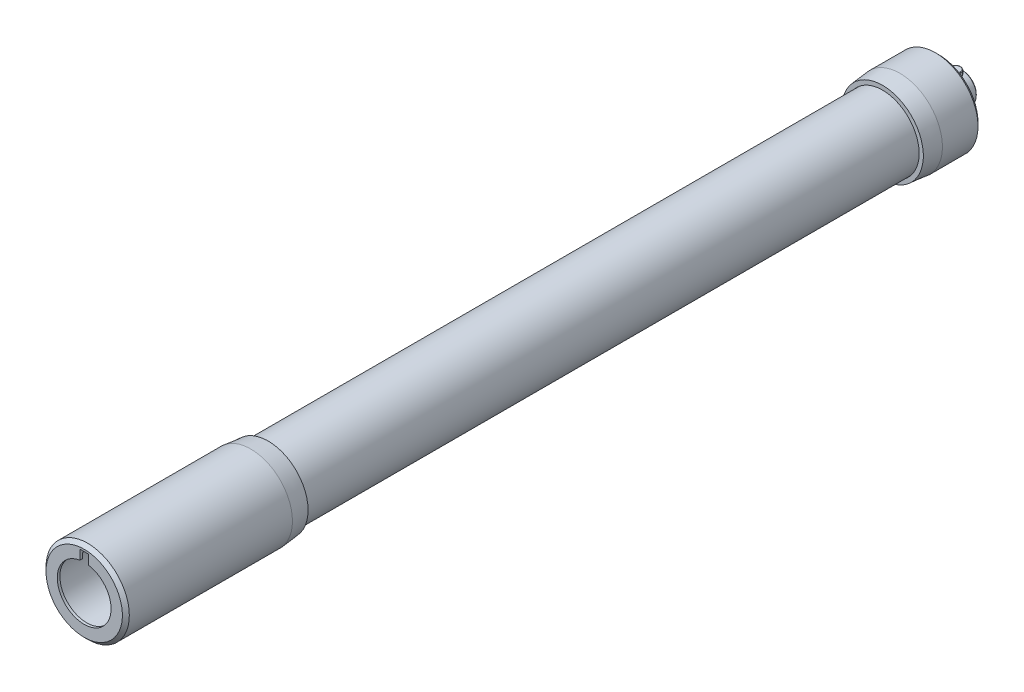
ISO-10303-21;
HEADER;
FILE_DESCRIPTION(('STEP AP214'),'2;1');
FILE_NAME('part.step','',(''),(''),'','','');
FILE_SCHEMA(('AUTOMOTIVE_DESIGN { 1 0 10303 214 1 1 1 1 }'));
ENDSEC;
DATA;
#1=APPLICATION_CONTEXT('core data for automotive mechanical design processes');
#2=APPLICATION_PROTOCOL_DEFINITION('international standard','automotive_design',2000,#1);
#3=PRODUCT_CONTEXT('',#1,'mechanical');
#4=PRODUCT('Part','Part','',(#3));
#5=PRODUCT_RELATED_PRODUCT_CATEGORY('part','',(#4));
#6=PRODUCT_DEFINITION_FORMATION('','',#4);
#7=PRODUCT_DEFINITION_CONTEXT('part definition',#1,'design');
#8=PRODUCT_DEFINITION('design','',#6,#7);
#9=PRODUCT_DEFINITION_SHAPE('','',#8);
#10=(LENGTH_UNIT() NAMED_UNIT(*) SI_UNIT(.MILLI.,.METRE.));
#11=(NAMED_UNIT(*) PLANE_ANGLE_UNIT() SI_UNIT($,.RADIAN.));
#12=(NAMED_UNIT(*) SI_UNIT($,.STERADIAN.) SOLID_ANGLE_UNIT());
#13=UNCERTAINTY_MEASURE_WITH_UNIT(LENGTH_MEASURE(1.E-05),#10,'distance_accuracy_value','');
#14=(GEOMETRIC_REPRESENTATION_CONTEXT(3) GLOBAL_UNCERTAINTY_ASSIGNED_CONTEXT((#13)) GLOBAL_UNIT_ASSIGNED_CONTEXT((#10,
#11,#12)) REPRESENTATION_CONTEXT('',''));
#15=CARTESIAN_POINT('',(0.,0.,0.));
#16=DIRECTION('',(0.,0.,1.));
#17=DIRECTION('',(1.,0.,0.));
#18=AXIS2_PLACEMENT_3D('',#15,#16,#17);
#19=CARTESIAN_POINT('',(-7.86674183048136,5.93283446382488,269.));
#20=DIRECTION('',(0.,0.,1.));
#21=DIRECTION('',(1.,0.,0.));
#22=AXIS2_PLACEMENT_3D('',#19,#20,#21);
#23=CYLINDRICAL_SURFACE('',#22,19.);
#24=CARTESIAN_POINT('',(-7.86674183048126,5.93283446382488,683.));
#25=DIRECTION('',(0.,0.,1.));
#26=DIRECTION('',(1.,0.,0.));
#27=AXIS2_PLACEMENT_3D('',#24,#25,#26);
#28=CIRCLE('',#27,19.);
#29=CARTESIAN_POINT('',(11.1332581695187,5.93283446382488,683.));
#30=VERTEX_POINT('',#29);
#31=EDGE_CURVE('P0_E26',#30,#30,#28,.T.);
#32=ORIENTED_EDGE('',*,*,#31,.T.);
#33=EDGE_LOOP('',(#32));
#34=FACE_BOUND('',#33,.T.);
#35=CARTESIAN_POINT('',(-7.86674183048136,5.93283446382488,269.));
#36=DIRECTION('',(0.,0.,1.));
#37=DIRECTION('',(1.,0.,0.));
#38=AXIS2_PLACEMENT_3D('',#35,#36,#37);
#39=CIRCLE('',#38,19.);
#40=CARTESIAN_POINT('',(11.1332581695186,5.93283446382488,269.));
#41=VERTEX_POINT('',#40);
#42=EDGE_CURVE('P0_E17',#41,#41,#39,.T.);
#43=ORIENTED_EDGE('',*,*,#42,.F.);
#44=EDGE_LOOP('',(#43));
#45=FACE_BOUND('',#44,.T.);
#46=ADVANCED_FACE('P0_F14',(#34,#45),#23,.F.);
#47=CARTESIAN_POINT('',(-7.86674183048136,5.93283446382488,269.));
#48=DIRECTION('',(0.,0.,-1.));
#49=DIRECTION('',(-1.,0.,0.));
#50=AXIS2_PLACEMENT_3D('',#47,#48,#49);
#51=PLANE('',#50);
#52=ORIENTED_EDGE('',*,*,#42,.T.);
#53=EDGE_LOOP('',(#52));
#54=FACE_BOUND('',#53,.T.);
#55=CARTESIAN_POINT('',(-7.86674183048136,5.93283446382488,269.));
#56=DIRECTION('',(0.,0.,1.));
#57=DIRECTION('',(1.,0.,0.));
#58=AXIS2_PLACEMENT_3D('',#55,#56,#57);
#59=CIRCLE('',#58,21.);
#60=CARTESIAN_POINT('',(13.1332581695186,5.93283446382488,269.));
#61=VERTEX_POINT('',#60);
#62=EDGE_CURVE('P0_E21',#61,#61,#59,.T.);
#63=ORIENTED_EDGE('',*,*,#62,.F.);
#64=EDGE_LOOP('',(#63));
#65=FACE_BOUND('',#64,.T.);
#66=ADVANCED_FACE('P0_F34',(#54,#65),#51,.T.);
#67=CARTESIAN_POINT('',(-7.86674183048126,5.93283446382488,683.));
#68=DIRECTION('',(0.,0.,-1.));
#69=DIRECTION('',(-1.,0.,0.));
#70=AXIS2_PLACEMENT_3D('',#67,#68,#69);
#71=PLANE('',#70);
#72=ORIENTED_EDGE('',*,*,#31,.F.);
#73=EDGE_LOOP('',(#72));
#74=FACE_BOUND('',#73,.T.);
#75=CARTESIAN_POINT('',(-7.86674183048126,5.93283446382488,683.));
#76=DIRECTION('',(0.,0.,1.));
#77=DIRECTION('',(1.,0.,0.));
#78=AXIS2_PLACEMENT_3D('',#75,#76,#77);
#79=CIRCLE('',#78,21.);
#80=CARTESIAN_POINT('',(13.1332581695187,5.93283446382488,683.));
#81=VERTEX_POINT('',#80);
#82=EDGE_CURVE('P0_E10',#81,#81,#79,.F.);
#83=ORIENTED_EDGE('',*,*,#82,.F.);
#84=EDGE_LOOP('',(#83));
#85=FACE_BOUND('',#84,.T.);
#86=ADVANCED_FACE('P0_F42',(#74,#85),#71,.F.);
#87=CARTESIAN_POINT('',(-7.86674183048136,5.93283446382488,269.));
#88=DIRECTION('',(0.,0.,1.));
#89=DIRECTION('',(1.,0.,0.));
#90=AXIS2_PLACEMENT_3D('',#87,#88,#89);
#91=CYLINDRICAL_SURFACE('',#90,21.);
#92=ORIENTED_EDGE('',*,*,#82,.T.);
#93=EDGE_LOOP('',(#92));
#94=FACE_BOUND('',#93,.T.);
#95=ORIENTED_EDGE('',*,*,#62,.T.);
#96=EDGE_LOOP('',(#95));
#97=FACE_BOUND('',#96,.T.);
#98=ADVANCED_FACE('P0_F43',(#94,#97),#91,.T.);
#99=CLOSED_SHELL('',(#46,#66,#86,#98));
#100=MANIFOLD_SOLID_BREP('P0_B1',#99);
#101=CARTESIAN_POINT('',(-7.86674183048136,10.4328344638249,257.));
#102=DIRECTION('',(0.,1.,0.));
#103=DIRECTION('',(-1.,0.,0.));
#104=AXIS2_PLACEMENT_3D('',#101,#102,#103);
#105=PLANE('',#104);
#106=CARTESIAN_POINT('',(-7.86674183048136,10.4328344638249,263.));
#107=DIRECTION('',(0.,1.,0.));
#108=DIRECTION('',(0.,0.,1.));
#109=AXIS2_PLACEMENT_3D('',#106,#107,#108);
#110=CIRCLE('',#109,2.59999999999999);
#111=CARTESIAN_POINT('',(-7.86674183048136,10.4328344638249,265.6));
#112=VERTEX_POINT('',#111);
#113=CARTESIAN_POINT('',(-5.26674183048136,10.4328344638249,263.));
#114=VERTEX_POINT('',#113);
#115=EDGE_CURVE('P1_E93',#112,#114,#110,.T.);
#116=ORIENTED_EDGE('',*,*,#115,.F.);
#117=CARTESIAN_POINT('',(-7.86674183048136,10.4328344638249,263.));
#118=DIRECTION('',(0.,1.,0.));
#119=DIRECTION('',(-1.,0.,0.));
#120=AXIS2_PLACEMENT_3D('',#117,#118,#119);
#121=CIRCLE('',#120,2.59999999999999);
#122=CARTESIAN_POINT('',(-10.4667418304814,10.4328344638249,263.));
#123=VERTEX_POINT('',#122);
#124=EDGE_CURVE('P1_E86',#123,#112,#121,.T.);
#125=ORIENTED_EDGE('',*,*,#124,.F.);
#126=DIRECTION('',(0.,0.,1.));
#127=VECTOR('',#126,1.);
#128=CARTESIAN_POINT('',(-10.4667418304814,10.4328344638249,257.));
#129=LINE('',#128,#127);
#130=CARTESIAN_POINT('',(-10.4667418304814,10.4328344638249,257.));
#131=VERTEX_POINT('',#130);
#132=EDGE_CURVE('P1_E90',#131,#123,#129,.T.);
#133=ORIENTED_EDGE('',*,*,#132,.F.);
#134=CARTESIAN_POINT('',(-7.86674183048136,10.4328344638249,257.));
#135=DIRECTION('',(0.,1.,0.));
#136=DIRECTION('',(1.,0.,0.));
#137=AXIS2_PLACEMENT_3D('',#134,#135,#136);
#138=CIRCLE('',#137,2.59999999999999);
#139=CARTESIAN_POINT('',(-5.26674183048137,10.4328344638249,257.));
#140=VERTEX_POINT('',#139);
#141=EDGE_CURVE('P1_E121',#140,#131,#138,.T.);
#142=ORIENTED_EDGE('',*,*,#141,.F.);
#143=DIRECTION('',(0.,0.,-1.));
#144=VECTOR('',#143,1.);
#145=CARTESIAN_POINT('',(-5.26674183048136,10.4328344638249,257.));
#146=LINE('',#145,#144);
#147=EDGE_CURVE('P1_E130',#114,#140,#146,.T.);
#148=ORIENTED_EDGE('',*,*,#147,.F.);
#149=EDGE_LOOP('',(#116,#125,#133,#142,#148));
#150=FACE_BOUND('',#149,.T.);
#151=ADVANCED_FACE('P1_F16',(#150),#105,.F.);
#152=CARTESIAN_POINT('',(-10.4667418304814,10.8328344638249,257.));
#153=DIRECTION('',(0.,0.,1.));
#154=DIRECTION('',(1.,0.,0.));
#155=AXIS2_PLACEMENT_3D('',#152,#153,#154);
#156=CYLINDRICAL_SURFACE('',#155,0.4);
#157=CARTESIAN_POINT('',(-10.4667418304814,10.8328344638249,263.));
#158=DIRECTION('',(0.,0.,1.));
#159=DIRECTION('',(-1.,0.,0.));
#160=AXIS2_PLACEMENT_3D('',#157,#158,#159);
#161=CIRCLE('',#160,0.4);
#162=CARTESIAN_POINT('',(-10.8667418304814,10.8328344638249,263.));
#163=VERTEX_POINT('',#162);
#164=EDGE_CURVE('P1_E97',#163,#123,#161,.T.);
#165=ORIENTED_EDGE('',*,*,#164,.F.);
#166=DIRECTION('',(0.,0.,-1.));
#167=VECTOR('',#166,1.);
#168=CARTESIAN_POINT('',(-10.8667418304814,10.8328344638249,257.));
#169=LINE('',#168,#167);
#170=CARTESIAN_POINT('',(-10.8667418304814,10.8328344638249,257.));
#171=VERTEX_POINT('',#170);
#172=EDGE_CURVE('P1_E324',#163,#171,#169,.T.);
#173=ORIENTED_EDGE('',*,*,#172,.T.);
#174=CARTESIAN_POINT('',(-10.4667418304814,10.8328344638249,257.));
#175=DIRECTION('',(0.,0.,1.));
#176=DIRECTION('',(-1.,0.,0.));
#177=AXIS2_PLACEMENT_3D('',#174,#175,#176);
#178=CIRCLE('',#177,0.4);
#179=EDGE_CURVE('P1_E105',#131,#171,#178,.F.);
#180=ORIENTED_EDGE('',*,*,#179,.F.);
#181=ORIENTED_EDGE('',*,*,#132,.T.);
#182=EDGE_LOOP('',(#165,#173,#180,#181));
#183=FACE_BOUND('',#182,.T.);
#184=ADVANCED_FACE('P1_F102',(#183),#156,.T.);
#185=CARTESIAN_POINT('',(-7.86674183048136,10.8328344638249,263.));
#186=DIRECTION('',(0.,1.,0.));
#187=DIRECTION('',(0.,0.,1.));
#188=AXIS2_PLACEMENT_3D('',#185,#186,#187);
#189=TOROIDAL_SURFACE('',#188,2.59999999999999,0.4);
#190=CARTESIAN_POINT('',(-5.26674183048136,10.8328344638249,263.));
#191=DIRECTION('',(0.,0.,-1.));
#192=DIRECTION('',(-1.,0.,0.));
#193=AXIS2_PLACEMENT_3D('',#190,#191,#192);
#194=CIRCLE('',#193,0.4);
#195=CARTESIAN_POINT('',(-4.86674183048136,10.8328344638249,263.));
#196=VERTEX_POINT('',#195);
#197=EDGE_CURVE('P1_E112',#196,#114,#194,.T.);
#198=ORIENTED_EDGE('',*,*,#197,.F.);
#199=CARTESIAN_POINT('',(-7.86674183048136,10.8328344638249,263.));
#200=DIRECTION('',(0.,-1.,0.));
#201=DIRECTION('',(1.,0.,0.));
#202=AXIS2_PLACEMENT_3D('',#199,#200,#201);
#203=CIRCLE('',#202,3.);
#204=EDGE_CURVE('P1_E110',#163,#196,#203,.F.);
#205=ORIENTED_EDGE('',*,*,#204,.F.);
#206=ORIENTED_EDGE('',*,*,#164,.T.);
#207=ORIENTED_EDGE('',*,*,#124,.T.);
#208=ORIENTED_EDGE('',*,*,#115,.T.);
#209=EDGE_LOOP('',(#198,#205,#206,#207,#208));
#210=FACE_BOUND('',#209,.T.);
#211=ADVANCED_FACE('P1_F108',(#210),#189,.T.);
#212=CARTESIAN_POINT('',(-5.26674183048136,10.8328344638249,257.));
#213=DIRECTION('',(0.,0.,-1.));
#214=DIRECTION('',(-1.,0.,0.));
#215=AXIS2_PLACEMENT_3D('',#212,#213,#214);
#216=CYLINDRICAL_SURFACE('',#215,0.4);
#217=ORIENTED_EDGE('',*,*,#197,.T.);
#218=ORIENTED_EDGE('',*,*,#147,.T.);
#219=CARTESIAN_POINT('',(-5.26674183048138,10.8328344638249,257.));
#220=DIRECTION('',(0.,0.,-1.));
#221=DIRECTION('',(1.,0.,0.));
#222=AXIS2_PLACEMENT_3D('',#219,#220,#221);
#223=CIRCLE('',#222,0.4);
#224=CARTESIAN_POINT('',(-4.86674183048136,10.8328344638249,257.));
#225=VERTEX_POINT('',#224);
#226=EDGE_CURVE('P1_E134',#225,#140,#223,.T.);
#227=ORIENTED_EDGE('',*,*,#226,.F.);
#228=DIRECTION('',(0.,0.,1.));
#229=VECTOR('',#228,1.);
#230=CARTESIAN_POINT('',(-4.86674183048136,10.8328344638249,257.));
#231=LINE('',#230,#229);
#232=EDGE_CURVE('P1_E150',#225,#196,#231,.T.);
#233=ORIENTED_EDGE('',*,*,#232,.T.);
#234=EDGE_LOOP('',(#217,#218,#227,#233));
#235=FACE_BOUND('',#234,.T.);
#236=ADVANCED_FACE('P1_F160',(#235),#216,.T.);
#237=CARTESIAN_POINT('',(-7.86674183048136,10.8328344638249,257.));
#238=DIRECTION('',(0.,1.,0.));
#239=DIRECTION('',(0.,0.,1.));
#240=AXIS2_PLACEMENT_3D('',#237,#238,#239);
#241=TOROIDAL_SURFACE('',#240,2.59999999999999,0.4);
#242=CARTESIAN_POINT('',(-7.86674183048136,10.8328344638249,257.));
#243=DIRECTION('',(0.,-1.,0.));
#244=DIRECTION('',(1.,0.,0.));
#245=AXIS2_PLACEMENT_3D('',#242,#243,#244);
#246=CIRCLE('',#245,3.);
#247=EDGE_CURVE('P1_E138',#225,#171,#246,.F.);
#248=ORIENTED_EDGE('',*,*,#247,.F.);
#249=ORIENTED_EDGE('',*,*,#226,.T.);
#250=ORIENTED_EDGE('',*,*,#141,.T.);
#251=ORIENTED_EDGE('',*,*,#179,.T.);
#252=EDGE_LOOP('',(#248,#249,#250,#251));
#253=FACE_BOUND('',#252,.T.);
#254=ADVANCED_FACE('P1_F136',(#253),#241,.T.);
#255=CARTESIAN_POINT('',(-10.8667418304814,16.4328344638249,257.));
#256=DIRECTION('',(1.,0.,0.));
#257=DIRECTION('',(0.,0.,-1.));
#258=AXIS2_PLACEMENT_3D('',#255,#256,#257);
#259=PLANE('',#258);
#260=DIRECTION('',(0.,0.,-1.));
#261=VECTOR('',#260,1.);
#262=CARTESIAN_POINT('',(-10.8667418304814,16.0328344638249,257.));
#263=LINE('',#262,#261);
#264=CARTESIAN_POINT('',(-10.8667418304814,16.0328344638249,257.));
#265=VERTEX_POINT('',#264);
#266=CARTESIAN_POINT('',(-10.8667418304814,16.0328344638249,263.));
#267=VERTEX_POINT('',#266);
#268=EDGE_CURVE('P1_E292',#265,#267,#263,.F.);
#269=ORIENTED_EDGE('',*,*,#268,.F.);
#270=DIRECTION('',(0.,-1.,0.));
#271=VECTOR('',#270,1.);
#272=CARTESIAN_POINT('',(-10.8667418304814,16.4328344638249,257.));
#273=LINE('',#272,#271);
#274=EDGE_CURVE('P1_E297',#171,#265,#273,.F.);
#275=ORIENTED_EDGE('',*,*,#274,.F.);
#276=ORIENTED_EDGE('',*,*,#172,.F.);
#277=DIRECTION('',(0.,-1.,0.));
#278=VECTOR('',#277,1.);
#279=CARTESIAN_POINT('',(-10.8667418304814,16.4328344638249,263.));
#280=LINE('',#279,#278);
#281=EDGE_CURVE('P1_E156',#267,#163,#280,.T.);
#282=ORIENTED_EDGE('',*,*,#281,.F.);
#283=EDGE_LOOP('',(#269,#275,#276,#282));
#284=FACE_BOUND('',#283,.T.);
#285=ADVANCED_FACE('P1_F337',(#284),#259,.F.);
#286=CARTESIAN_POINT('',(-7.86674183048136,16.4328344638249,263.));
#287=DIRECTION('',(0.,-1.,0.));
#288=DIRECTION('',(1.,0.,0.));
#289=AXIS2_PLACEMENT_3D('',#286,#287,#288);
#290=CYLINDRICAL_SURFACE('',#289,3.);
#291=ORIENTED_EDGE('',*,*,#281,.T.);
#292=ORIENTED_EDGE('',*,*,#204,.T.);
#293=DIRECTION('',(0.,-1.,0.));
#294=VECTOR('',#293,1.);
#295=CARTESIAN_POINT('',(-4.86674183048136,16.4328344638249,263.));
#296=LINE('',#295,#294);
#297=CARTESIAN_POINT('',(-4.86674183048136,16.0328344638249,263.));
#298=VERTEX_POINT('',#297);
#299=EDGE_CURVE('P1_E152',#196,#298,#296,.F.);
#300=ORIENTED_EDGE('',*,*,#299,.T.);
#301=CARTESIAN_POINT('',(-7.86674183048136,16.0328344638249,263.));
#302=DIRECTION('',(0.,1.,0.));
#303=DIRECTION('',(0.,0.,1.));
#304=AXIS2_PLACEMENT_3D('',#301,#302,#303);
#305=CIRCLE('',#304,3.);
#306=EDGE_CURVE('P1_E259',#267,#298,#305,.T.);
#307=ORIENTED_EDGE('',*,*,#306,.F.);
#308=EDGE_LOOP('',(#291,#292,#300,#307));
#309=FACE_BOUND('',#308,.T.);
#310=ADVANCED_FACE('P1_F363',(#309),#290,.T.);
#311=CARTESIAN_POINT('',(-4.86674183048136,16.4328344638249,257.));
#312=DIRECTION('',(-1.,0.,0.));
#313=DIRECTION('',(0.,-1.,0.));
#314=AXIS2_PLACEMENT_3D('',#311,#312,#313);
#315=PLANE('',#314);
#316=DIRECTION('',(0.,0.,1.));
#317=VECTOR('',#316,1.);
#318=CARTESIAN_POINT('',(-4.86674183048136,16.0328344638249,257.));
#319=LINE('',#318,#317);
#320=CARTESIAN_POINT('',(-4.86674183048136,16.0328344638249,257.));
#321=VERTEX_POINT('',#320);
#322=EDGE_CURVE('P1_E253',#298,#321,#319,.F.);
#323=ORIENTED_EDGE('',*,*,#322,.F.);
#324=ORIENTED_EDGE('',*,*,#299,.F.);
#325=ORIENTED_EDGE('',*,*,#232,.F.);
#326=DIRECTION('',(0.,-1.,0.));
#327=VECTOR('',#326,1.);
#328=CARTESIAN_POINT('',(-4.86674183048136,16.4328344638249,257.));
#329=LINE('',#328,#327);
#330=EDGE_CURVE('P1_E307',#321,#225,#329,.T.);
#331=ORIENTED_EDGE('',*,*,#330,.F.);
#332=EDGE_LOOP('',(#323,#324,#325,#331));
#333=FACE_BOUND('',#332,.T.);
#334=ADVANCED_FACE('P1_F367',(#333),#315,.F.);
#335=CARTESIAN_POINT('',(-7.86674183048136,16.4328344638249,257.));
#336=DIRECTION('',(0.,-1.,0.));
#337=DIRECTION('',(1.,0.,0.));
#338=AXIS2_PLACEMENT_3D('',#335,#336,#337);
#339=CYLINDRICAL_SURFACE('',#338,3.);
#340=ORIENTED_EDGE('',*,*,#247,.T.);
#341=ORIENTED_EDGE('',*,*,#274,.T.);
#342=CARTESIAN_POINT('',(-7.86674183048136,16.0328344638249,257.));
#343=DIRECTION('',(0.,1.,0.));
#344=DIRECTION('',(0.,0.,1.));
#345=AXIS2_PLACEMENT_3D('',#342,#343,#344);
#346=CIRCLE('',#345,3.);
#347=EDGE_CURVE('P1_E249',#321,#265,#346,.T.);
#348=ORIENTED_EDGE('',*,*,#347,.F.);
#349=ORIENTED_EDGE('',*,*,#330,.T.);
#350=EDGE_LOOP('',(#340,#341,#348,#349));
#351=FACE_BOUND('',#350,.T.);
#352=ADVANCED_FACE('P1_F370',(#351),#339,.T.);
#353=CARTESIAN_POINT('',(-10.4667418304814,16.0328344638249,257.));
#354=DIRECTION('',(0.,0.,-1.));
#355=DIRECTION('',(-1.,0.,0.));
#356=AXIS2_PLACEMENT_3D('',#353,#354,#355);
#357=CYLINDRICAL_SURFACE('',#356,0.4);
#358=CARTESIAN_POINT('',(-10.4667418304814,16.0328344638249,263.));
#359=DIRECTION('',(0.,0.,1.));
#360=DIRECTION('',(-1.,0.,0.));
#361=AXIS2_PLACEMENT_3D('',#358,#359,#360);
#362=CIRCLE('',#361,0.4);
#363=CARTESIAN_POINT('',(-10.4667418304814,16.4328344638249,263.));
#364=VERTEX_POINT('',#363);
#365=EDGE_CURVE('P1_E284',#364,#267,#362,.T.);
#366=ORIENTED_EDGE('',*,*,#365,.F.);
#367=DIRECTION('',(0.,0.,1.));
#368=VECTOR('',#367,1.);
#369=CARTESIAN_POINT('',(-10.4667418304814,16.4328344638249,257.));
#370=LINE('',#369,#368);
#371=CARTESIAN_POINT('',(-10.4667418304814,16.4328344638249,257.));
#372=VERTEX_POINT('',#371);
#373=EDGE_CURVE('P1_E231',#372,#364,#370,.T.);
#374=ORIENTED_EDGE('',*,*,#373,.F.);
#375=CARTESIAN_POINT('',(-10.4667418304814,16.0328344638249,257.));
#376=DIRECTION('',(0.,0.,1.));
#377=DIRECTION('',(-1.,0.,0.));
#378=AXIS2_PLACEMENT_3D('',#375,#376,#377);
#379=CIRCLE('',#378,0.4);
#380=EDGE_CURVE('P1_E236',#265,#372,#379,.F.);
#381=ORIENTED_EDGE('',*,*,#380,.F.);
#382=ORIENTED_EDGE('',*,*,#268,.T.);
#383=EDGE_LOOP('',(#366,#374,#381,#382));
#384=FACE_BOUND('',#383,.T.);
#385=ADVANCED_FACE('P1_F270',(#384),#357,.T.);
#386=CARTESIAN_POINT('',(-7.86674183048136,16.0328344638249,263.));
#387=DIRECTION('',(0.,1.,0.));
#388=DIRECTION('',(0.,0.,1.));
#389=AXIS2_PLACEMENT_3D('',#386,#387,#388);
#390=TOROIDAL_SURFACE('',#389,2.59999999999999,0.4);
#391=CARTESIAN_POINT('',(-5.26674183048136,16.0328344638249,263.));
#392=DIRECTION('',(0.,0.,1.));
#393=DIRECTION('',(1.,0.,0.));
#394=AXIS2_PLACEMENT_3D('',#391,#392,#393);
#395=CIRCLE('',#394,0.4);
#396=CARTESIAN_POINT('',(-5.26674183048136,16.4328344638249,263.));
#397=VERTEX_POINT('',#396);
#398=EDGE_CURVE('P1_E256',#397,#298,#395,.F.);
#399=ORIENTED_EDGE('',*,*,#398,.F.);
#400=CARTESIAN_POINT('',(-7.86674183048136,16.4328344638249,263.));
#401=DIRECTION('',(0.,-1.,0.));
#402=DIRECTION('',(1.,0.,0.));
#403=AXIS2_PLACEMENT_3D('',#400,#401,#402);
#404=CIRCLE('',#403,2.59999999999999);
#405=CARTESIAN_POINT('',(-7.86674183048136,16.4328344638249,265.6));
#406=VERTEX_POINT('',#405);
#407=EDGE_CURVE('P1_E221',#406,#397,#404,.F.);
#408=ORIENTED_EDGE('',*,*,#407,.F.);
#409=CARTESIAN_POINT('',(-7.86674183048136,16.4328344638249,263.));
#410=DIRECTION('',(0.,-1.,0.));
#411=DIRECTION('',(0.,0.,1.));
#412=AXIS2_PLACEMENT_3D('',#409,#410,#411);
#413=CIRCLE('',#412,2.59999999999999);
#414=EDGE_CURVE('P1_E383',#364,#406,#413,.F.);
#415=ORIENTED_EDGE('',*,*,#414,.F.);
#416=ORIENTED_EDGE('',*,*,#365,.T.);
#417=ORIENTED_EDGE('',*,*,#306,.T.);
#418=EDGE_LOOP('',(#399,#408,#415,#416,#417));
#419=FACE_BOUND('',#418,.T.);
#420=ADVANCED_FACE('P1_F266',(#419),#390,.T.);
#421=CARTESIAN_POINT('',(-5.26674183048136,16.0328344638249,257.));
#422=DIRECTION('',(0.,0.,1.));
#423=DIRECTION('',(1.,0.,0.));
#424=AXIS2_PLACEMENT_3D('',#421,#422,#423);
#425=CYLINDRICAL_SURFACE('',#424,0.4);
#426=ORIENTED_EDGE('',*,*,#398,.T.);
#427=ORIENTED_EDGE('',*,*,#322,.T.);
#428=CARTESIAN_POINT('',(-5.26674183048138,16.0328344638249,257.));
#429=DIRECTION('',(0.,0.,-1.));
#430=DIRECTION('',(1.,0.,0.));
#431=AXIS2_PLACEMENT_3D('',#428,#429,#430);
#432=CIRCLE('',#431,0.4);
#433=CARTESIAN_POINT('',(-5.26674183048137,16.4328344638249,257.));
#434=VERTEX_POINT('',#433);
#435=EDGE_CURVE('P1_E36',#434,#321,#432,.T.);
#436=ORIENTED_EDGE('',*,*,#435,.F.);
#437=DIRECTION('',(0.,0.,1.));
#438=VECTOR('',#437,1.);
#439=CARTESIAN_POINT('',(-5.26674183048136,16.4328344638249,257.));
#440=LINE('',#439,#438);
#441=EDGE_CURVE('P1_E28',#397,#434,#440,.F.);
#442=ORIENTED_EDGE('',*,*,#441,.F.);
#443=EDGE_LOOP('',(#426,#427,#436,#442));
#444=FACE_BOUND('',#443,.T.);
#445=ADVANCED_FACE('P1_F193',(#444),#425,.T.);
#446=CARTESIAN_POINT('',(-7.86674183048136,16.0328344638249,257.));
#447=DIRECTION('',(0.,1.,0.));
#448=DIRECTION('',(0.,0.,1.));
#449=AXIS2_PLACEMENT_3D('',#446,#447,#448);
#450=TOROIDAL_SURFACE('',#449,2.59999999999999,0.4);
#451=ORIENTED_EDGE('',*,*,#380,.T.);
#452=CARTESIAN_POINT('',(-7.86674183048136,16.4328344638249,257.));
#453=DIRECTION('',(0.,-1.,0.));
#454=DIRECTION('',(-1.,0.,0.));
#455=AXIS2_PLACEMENT_3D('',#452,#453,#454);
#456=CIRCLE('',#455,2.59999999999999);
#457=EDGE_CURVE('P1_E11',#434,#372,#456,.F.);
#458=ORIENTED_EDGE('',*,*,#457,.F.);
#459=ORIENTED_EDGE('',*,*,#435,.T.);
#460=ORIENTED_EDGE('',*,*,#347,.T.);
#461=EDGE_LOOP('',(#451,#458,#459,#460));
#462=FACE_BOUND('',#461,.T.);
#463=ADVANCED_FACE('P1_F187',(#462),#450,.T.);
#464=CARTESIAN_POINT('',(-7.86674183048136,16.4328344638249,257.));
#465=DIRECTION('',(0.,1.,0.));
#466=DIRECTION('',(-1.,0.,0.));
#467=AXIS2_PLACEMENT_3D('',#464,#465,#466);
#468=PLANE('',#467);
#469=ORIENTED_EDGE('',*,*,#441,.T.);
#470=ORIENTED_EDGE('',*,*,#457,.T.);
#471=ORIENTED_EDGE('',*,*,#373,.T.);
#472=ORIENTED_EDGE('',*,*,#414,.T.);
#473=ORIENTED_EDGE('',*,*,#407,.T.);
#474=EDGE_LOOP('',(#469,#470,#471,#472,#473));
#475=FACE_BOUND('',#474,.T.);
#476=ADVANCED_FACE('P1_F185',(#475),#468,.T.);
#477=CLOSED_SHELL('',(#151,#184,#211,#236,#254,#285,#310,#334,#352,#385,#420,#445,#463,#476));
#478=MANIFOLD_SOLID_BREP('P1_B1',#477);
#479=CARTESIAN_POINT('',(-7.86674183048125,5.93283446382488,687.5));
#480=DIRECTION('',(0.,0.,-1.));
#481=DIRECTION('',(-1.,0.,0.));
#482=AXIS2_PLACEMENT_3D('',#479,#480,#481);
#483=CYLINDRICAL_SURFACE('',#482,19.6);
#484=CARTESIAN_POINT('',(-7.86674183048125,5.93283446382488,687.5));
#485=DIRECTION('',(0.,0.,-1.));
#486=DIRECTION('',(-1.,0.,0.));
#487=AXIS2_PLACEMENT_3D('',#484,#485,#486);
#488=CIRCLE('',#487,19.6);
#489=CARTESIAN_POINT('',(-5.36674183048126,25.3727418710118,687.5));
#490=VERTEX_POINT('',#489);
#491=CARTESIAN_POINT('',(-10.3667418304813,25.3727418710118,687.5));
#492=VERTEX_POINT('',#491);
#493=EDGE_CURVE('P2_E99',#490,#492,#488,.T.);
#494=ORIENTED_EDGE('',*,*,#493,.F.);
#495=DIRECTION('',(0.,0.,-1.));
#496=VECTOR('',#495,1.);
#497=CARTESIAN_POINT('',(-5.36674183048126,25.3727418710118,687.5));
#498=LINE('',#497,#496);
#499=CARTESIAN_POINT('',(-5.36674183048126,25.3727418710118,685.9));
#500=VERTEX_POINT('',#499);
#501=EDGE_CURVE('P2_E97',#500,#490,#498,.F.);
#502=ORIENTED_EDGE('',*,*,#501,.F.);
#503=CARTESIAN_POINT('',(-7.86674183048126,5.93283446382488,685.9));
#504=DIRECTION('',(0.,0.,-1.));
#505=DIRECTION('',(-1.,0.,0.));
#506=AXIS2_PLACEMENT_3D('',#503,#504,#505);
#507=CIRCLE('',#506,19.6);
#508=CARTESIAN_POINT('',(-10.3667418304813,25.3727418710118,685.9));
#509=VERTEX_POINT('',#508);
#510=EDGE_CURVE('P2_E19',#500,#509,#507,.T.);
#511=ORIENTED_EDGE('',*,*,#510,.T.);
#512=DIRECTION('',(0.,0.,-1.));
#513=VECTOR('',#512,1.);
#514=CARTESIAN_POINT('',(-10.3667418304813,25.3727418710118,687.5));
#515=LINE('',#514,#513);
#516=EDGE_CURVE('P2_E84',#492,#509,#515,.T.);
#517=ORIENTED_EDGE('',*,*,#516,.F.);
#518=EDGE_LOOP('',(#494,#502,#511,#517));
#519=FACE_BOUND('',#518,.T.);
#520=ADVANCED_FACE('P2_F16',(#519),#483,.F.);
#521=CARTESIAN_POINT('',(-7.86674183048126,5.93283446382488,683.));
#522=DIRECTION('',(0.,0.,-1.));
#523=DIRECTION('',(-1.,0.,0.));
#524=AXIS2_PLACEMENT_3D('',#521,#522,#523);
#525=CYLINDRICAL_SURFACE('',#524,21.05);
#526=CARTESIAN_POINT('',(-7.86674183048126,5.93283446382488,673.));
#527=DIRECTION('',(0.,0.,-1.));
#528=DIRECTION('',(-1.,0.,0.));
#529=AXIS2_PLACEMENT_3D('',#526,#527,#528);
#530=CIRCLE('',#529,21.05);
#531=CARTESIAN_POINT('',(-28.9167418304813,5.93283446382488,673.));
#532=VERTEX_POINT('',#531);
#533=EDGE_CURVE('P2_E149',#532,#532,#530,.F.);
#534=ORIENTED_EDGE('',*,*,#533,.F.);
#535=EDGE_LOOP('',(#534));
#536=FACE_BOUND('',#535,.T.);
#537=CARTESIAN_POINT('',(-7.86674183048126,5.93283446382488,683.));
#538=DIRECTION('',(0.,0.,-1.));
#539=DIRECTION('',(-1.,0.,0.));
#540=AXIS2_PLACEMENT_3D('',#537,#538,#539);
#541=CIRCLE('',#540,21.05);
#542=CARTESIAN_POINT('',(-28.9167418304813,5.93283446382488,683.));
#543=VERTEX_POINT('',#542);
#544=EDGE_CURVE('P2_E146',#543,#543,#541,.T.);
#545=ORIENTED_EDGE('',*,*,#544,.F.);
#546=EDGE_LOOP('',(#545));
#547=FACE_BOUND('',#546,.T.);
#548=ADVANCED_FACE('P2_F306',(#536,#547),#525,.F.);
#549=CARTESIAN_POINT('',(-7.86674183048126,5.93283446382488,685.9));
#550=DIRECTION('',(0.,0.,-1.));
#551=DIRECTION('',(-1.,0.,0.));
#552=AXIS2_PLACEMENT_3D('',#549,#550,#551);
#553=PLANE('',#552);
#554=CARTESIAN_POINT('',(-7.86674183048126,5.93283446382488,685.9));
#555=DIRECTION('',(0.,0.,-1.));
#556=DIRECTION('',(-1.,0.,0.));
#557=AXIS2_PLACEMENT_3D('',#554,#555,#556);
#558=CIRCLE('',#557,18.5);
#559=CARTESIAN_POINT('',(-5.36674183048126,24.2631372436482,685.9));
#560=VERTEX_POINT('',#559);
#561=CARTESIAN_POINT('',(-10.3667418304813,24.2631372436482,685.9));
#562=VERTEX_POINT('',#561);
#563=EDGE_CURVE('P2_E142',#560,#562,#558,.T.);
#564=ORIENTED_EDGE('',*,*,#563,.T.);
#565=DIRECTION('',(0.,1.,0.));
#566=VECTOR('',#565,1.);
#567=CARTESIAN_POINT('',(-10.3667418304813,5.93283446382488,685.9));
#568=LINE('',#567,#566);
#569=EDGE_CURVE('P2_E94',#509,#562,#568,.F.);
#570=ORIENTED_EDGE('',*,*,#569,.F.);
#571=ORIENTED_EDGE('',*,*,#510,.F.);
#572=DIRECTION('',(0.,1.,0.));
#573=VECTOR('',#572,1.);
#574=CARTESIAN_POINT('',(-5.36674183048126,5.93283446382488,685.9));
#575=LINE('',#574,#573);
#576=EDGE_CURVE('P2_E92',#560,#500,#575,.T.);
#577=ORIENTED_EDGE('',*,*,#576,.F.);
#578=EDGE_LOOP('',(#564,#570,#571,#577));
#579=FACE_BOUND('',#578,.T.);
#580=ADVANCED_FACE('P2_F90',(#579),#553,.F.);
#581=CARTESIAN_POINT('',(-7.86674183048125,5.93283446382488,687.5));
#582=DIRECTION('',(0.,0.,-1.));
#583=DIRECTION('',(-1.,0.,0.));
#584=AXIS2_PLACEMENT_3D('',#581,#582,#583);
#585=PLANE('',#584);
#586=CARTESIAN_POINT('',(-7.86674183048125,5.93283446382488,687.5));
#587=DIRECTION('',(0.,0.,-1.));
#588=DIRECTION('',(-1.,0.,0.));
#589=AXIS2_PLACEMENT_3D('',#586,#587,#588);
#590=CIRCLE('',#589,18.5);
#591=CARTESIAN_POINT('',(-10.3667418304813,24.2631372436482,687.5));
#592=VERTEX_POINT('',#591);
#593=CARTESIAN_POINT('',(-5.36674183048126,24.2631372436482,687.5));
#594=VERTEX_POINT('',#593);
#595=EDGE_CURVE('P2_E139',#592,#594,#590,.F.);
#596=ORIENTED_EDGE('',*,*,#595,.T.);
#597=DIRECTION('',(0.,1.,0.));
#598=VECTOR('',#597,1.);
#599=CARTESIAN_POINT('',(-5.36674183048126,5.93283446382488,687.5));
#600=LINE('',#599,#598);
#601=EDGE_CURVE('P2_E151',#594,#490,#600,.T.);
#602=ORIENTED_EDGE('',*,*,#601,.T.);
#603=ORIENTED_EDGE('',*,*,#493,.T.);
#604=DIRECTION('',(0.,1.,0.));
#605=VECTOR('',#604,1.);
#606=CARTESIAN_POINT('',(-10.3667418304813,5.93283446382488,687.5));
#607=LINE('',#606,#605);
#608=EDGE_CURVE('P2_E109',#492,#592,#607,.F.);
#609=ORIENTED_EDGE('',*,*,#608,.T.);
#610=EDGE_LOOP('',(#596,#602,#603,#609));
#611=FACE_BOUND('',#610,.T.);
#612=ADVANCED_FACE('P2_F240',(#611),#585,.T.);
#613=CARTESIAN_POINT('',(-7.86674183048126,5.93283446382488,673.));
#614=DIRECTION('',(0.,0.,-1.));
#615=DIRECTION('',(-1.,0.,0.));
#616=AXIS2_PLACEMENT_3D('',#613,#614,#615);
#617=PLANE('',#616);
#618=ORIENTED_EDGE('',*,*,#533,.T.);
#619=EDGE_LOOP('',(#618));
#620=FACE_BOUND('',#619,.T.);
#621=CARTESIAN_POINT('',(-7.86674183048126,5.93283446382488,673.));
#622=DIRECTION('',(0.,0.,-1.));
#623=DIRECTION('',(-1.,0.,0.));
#624=AXIS2_PLACEMENT_3D('',#621,#622,#623);
#625=CIRCLE('',#624,21.1);
#626=CARTESIAN_POINT('',(-28.9667418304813,5.93283446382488,673.));
#627=VERTEX_POINT('',#626);
#628=EDGE_CURVE('P2_E133',#627,#627,#625,.T.);
#629=ORIENTED_EDGE('',*,*,#628,.T.);
#630=EDGE_LOOP('',(#629));
#631=FACE_BOUND('',#630,.T.);
#632=ADVANCED_FACE('P2_F237',(#620,#631),#617,.T.);
#633=CARTESIAN_POINT('',(-7.86674183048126,5.93283446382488,683.));
#634=DIRECTION('',(0.,0.,-1.));
#635=DIRECTION('',(-1.,0.,0.));
#636=AXIS2_PLACEMENT_3D('',#633,#634,#635);
#637=PLANE('',#636);
#638=DIRECTION('',(1.,0.,0.));
#639=VECTOR('',#638,1.);
#640=CARTESIAN_POINT('',(-7.86674183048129,26.7328344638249,683.));
#641=LINE('',#640,#639);
#642=CARTESIAN_POINT('',(-10.3667418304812,26.7328344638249,683.));
#643=VERTEX_POINT('',#642);
#644=CARTESIAN_POINT('',(-5.36674183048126,26.7328344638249,683.));
#645=VERTEX_POINT('',#644);
#646=EDGE_CURVE('P2_E136',#643,#645,#641,.T.);
#647=ORIENTED_EDGE('',*,*,#646,.F.);
#648=DIRECTION('',(0.,1.,0.));
#649=VECTOR('',#648,1.);
#650=CARTESIAN_POINT('',(-10.3667418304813,5.93283446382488,683.));
#651=LINE('',#650,#649);
#652=CARTESIAN_POINT('',(-10.3667418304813,24.2631372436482,683.));
#653=VERTEX_POINT('',#652);
#654=EDGE_CURVE('P2_E160',#653,#643,#651,.T.);
#655=ORIENTED_EDGE('',*,*,#654,.F.);
#656=CARTESIAN_POINT('',(-7.86674183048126,5.93283446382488,683.));
#657=DIRECTION('',(0.,0.,-1.));
#658=DIRECTION('',(-1.,0.,0.));
#659=AXIS2_PLACEMENT_3D('',#656,#657,#658);
#660=CIRCLE('',#659,18.5);
#661=CARTESIAN_POINT('',(-5.36674183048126,24.2631372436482,683.));
#662=VERTEX_POINT('',#661);
#663=EDGE_CURVE('P2_E144',#653,#662,#660,.F.);
#664=ORIENTED_EDGE('',*,*,#663,.T.);
#665=DIRECTION('',(0.,1.,0.));
#666=VECTOR('',#665,1.);
#667=CARTESIAN_POINT('',(-5.36674183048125,5.93283446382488,683.));
#668=LINE('',#667,#666);
#669=EDGE_CURVE('P2_E178',#645,#662,#668,.F.);
#670=ORIENTED_EDGE('',*,*,#669,.F.);
#671=EDGE_LOOP('',(#647,#655,#664,#670));
#672=FACE_BOUND('',#671,.T.);
#673=ORIENTED_EDGE('',*,*,#544,.T.);
#674=EDGE_LOOP('',(#673));
#675=FACE_BOUND('',#674,.T.);
#676=ADVANCED_FACE('P2_F239',(#672,#675),#637,.T.);
#677=CARTESIAN_POINT('',(-7.86674183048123,5.93283446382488,757.5));
#678=DIRECTION('',(0.,0.,-1.));
#679=DIRECTION('',(-1.,0.,0.));
#680=AXIS2_PLACEMENT_3D('',#677,#678,#679);
#681=CYLINDRICAL_SURFACE('',#680,18.5);
#682=ORIENTED_EDGE('',*,*,#563,.F.);
#683=DIRECTION('',(0.,0.,1.));
#684=VECTOR('',#683,1.);
#685=CARTESIAN_POINT('',(-5.36674183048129,24.2631372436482,586.));
#686=LINE('',#685,#684);
#687=EDGE_CURVE('P2_E107',#662,#560,#686,.T.);
#688=ORIENTED_EDGE('',*,*,#687,.F.);
#689=ORIENTED_EDGE('',*,*,#663,.F.);
#690=DIRECTION('',(0.,0.,-1.));
#691=VECTOR('',#690,1.);
#692=CARTESIAN_POINT('',(-10.3667418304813,24.2631372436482,586.));
#693=LINE('',#692,#691);
#694=EDGE_CURVE('P2_E157',#562,#653,#693,.T.);
#695=ORIENTED_EDGE('',*,*,#694,.F.);
#696=EDGE_LOOP('',(#682,#688,#689,#695));
#697=FACE_BOUND('',#696,.T.);
#698=ADVANCED_FACE('P2_F247',(#697),#681,.F.);
#699=CARTESIAN_POINT('',(-7.86674183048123,5.93283446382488,757.5));
#700=DIRECTION('',(0.,0.,-1.));
#701=DIRECTION('',(-1.,0.,0.));
#702=AXIS2_PLACEMENT_3D('',#699,#700,#701);
#703=CYLINDRICAL_SURFACE('',#702,18.5);
#704=CARTESIAN_POINT('',(-7.86674183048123,5.93283446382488,757.5));
#705=DIRECTION('',(0.,0.,-1.));
#706=DIRECTION('',(-1.,0.,0.));
#707=AXIS2_PLACEMENT_3D('',#704,#705,#706);
#708=CIRCLE('',#707,18.5);
#709=CARTESIAN_POINT('',(-5.36674183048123,24.2631372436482,757.5));
#710=VERTEX_POINT('',#709);
#711=CARTESIAN_POINT('',(-10.3667418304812,24.2631372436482,757.5));
#712=VERTEX_POINT('',#711);
#713=EDGE_CURVE('P2_E137',#710,#712,#708,.T.);
#714=ORIENTED_EDGE('',*,*,#713,.F.);
#715=DIRECTION('',(0.,0.,1.));
#716=VECTOR('',#715,1.);
#717=CARTESIAN_POINT('',(-5.36674183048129,24.2631372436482,586.));
#718=LINE('',#717,#716);
#719=EDGE_CURVE('P2_E181',#594,#710,#718,.T.);
#720=ORIENTED_EDGE('',*,*,#719,.F.);
#721=ORIENTED_EDGE('',*,*,#595,.F.);
#722=DIRECTION('',(0.,0.,-1.));
#723=VECTOR('',#722,1.);
#724=CARTESIAN_POINT('',(-10.3667418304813,24.2631372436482,586.));
#725=LINE('',#724,#723);
#726=EDGE_CURVE('P2_E166',#712,#592,#725,.T.);
#727=ORIENTED_EDGE('',*,*,#726,.F.);
#728=EDGE_LOOP('',(#714,#720,#721,#727));
#729=FACE_BOUND('',#728,.T.);
#730=ADVANCED_FACE('P2_F276',(#729),#703,.F.);
#731=CARTESIAN_POINT('',(-7.86674183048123,5.93283446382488,757.5));
#732=DIRECTION('',(0.,0.,-1.));
#733=DIRECTION('',(-1.,0.,0.));
#734=AXIS2_PLACEMENT_3D('',#731,#732,#733);
#735=PLANE('',#734);
#736=DIRECTION('',(0.,1.,0.));
#737=VECTOR('',#736,1.);
#738=CARTESIAN_POINT('',(-10.3667418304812,5.93283446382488,757.5));
#739=LINE('',#738,#737);
#740=CARTESIAN_POINT('',(-10.3667418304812,21.2298930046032,757.5));
#741=VERTEX_POINT('',#740);
#742=EDGE_CURVE('P2_E169',#741,#712,#739,.T.);
#743=ORIENTED_EDGE('',*,*,#742,.F.);
#744=CARTESIAN_POINT('',(-7.86674183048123,5.93283446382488,757.5));
#745=DIRECTION('',(0.,0.,1.));
#746=DIRECTION('',(1.,0.,0.));
#747=AXIS2_PLACEMENT_3D('',#744,#745,#746);
#748=CIRCLE('',#747,15.5);
#749=CARTESIAN_POINT('',(-5.36674183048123,21.2298930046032,757.5));
#750=VERTEX_POINT('',#749);
#751=EDGE_CURVE('P2_E129',#741,#750,#748,.T.);
#752=ORIENTED_EDGE('',*,*,#751,.T.);
#753=DIRECTION('',(0.,1.,0.));
#754=VECTOR('',#753,1.);
#755=CARTESIAN_POINT('',(-5.36674183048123,5.93283446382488,757.5));
#756=LINE('',#755,#754);
#757=EDGE_CURVE('P2_E184',#710,#750,#756,.F.);
#758=ORIENTED_EDGE('',*,*,#757,.F.);
#759=ORIENTED_EDGE('',*,*,#713,.T.);
#760=EDGE_LOOP('',(#743,#752,#758,#759));
#761=FACE_BOUND('',#760,.T.);
#762=ADVANCED_FACE('P2_F233',(#761),#735,.T.);
#763=CARTESIAN_POINT('',(-7.86674183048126,5.93283446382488,673.));
#764=DIRECTION('',(0.,0.,-1.));
#765=DIRECTION('',(-1.,0.,0.));
#766=AXIS2_PLACEMENT_3D('',#763,#764,#765);
#767=CYLINDRICAL_SURFACE('',#766,21.1);
#768=CARTESIAN_POINT('',(-7.86674183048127,5.93283446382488,653.));
#769=DIRECTION('',(0.,0.,-1.));
#770=DIRECTION('',(-1.,0.,0.));
#771=AXIS2_PLACEMENT_3D('',#768,#769,#770);
#772=CIRCLE('',#771,21.1);
#773=CARTESIAN_POINT('',(-28.9667418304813,5.93283446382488,653.));
#774=VERTEX_POINT('',#773);
#775=EDGE_CURVE('P2_E124',#774,#774,#772,.F.);
#776=ORIENTED_EDGE('',*,*,#775,.F.);
#777=EDGE_LOOP('',(#776));
#778=FACE_BOUND('',#777,.T.);
#779=ORIENTED_EDGE('',*,*,#628,.F.);
#780=EDGE_LOOP('',(#779));
#781=FACE_BOUND('',#780,.T.);
#782=ADVANCED_FACE('P2_F229',(#778,#781),#767,.F.);
#783=CARTESIAN_POINT('',(-7.86674183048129,26.7328344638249,586.));
#784=DIRECTION('',(0.,-1.,0.));
#785=DIRECTION('',(0.,0.,-1.));
#786=AXIS2_PLACEMENT_3D('',#783,#784,#785);
#787=PLANE('',#786);
#788=DIRECTION('',(0.,0.,1.));
#789=VECTOR('',#788,1.);
#790=CARTESIAN_POINT('',(-5.36674183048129,26.7328344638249,586.));
#791=LINE('',#790,#789);
#792=CARTESIAN_POINT('',(-5.36674183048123,26.7328344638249,759.));
#793=VERTEX_POINT('',#792);
#794=EDGE_CURVE('P2_E131',#793,#645,#791,.F.);
#795=ORIENTED_EDGE('',*,*,#794,.F.);
#796=DIRECTION('',(-1.,0.,0.));
#797=VECTOR('',#796,1.);
#798=CARTESIAN_POINT('',(-7.86674183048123,26.7328344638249,759.));
#799=LINE('',#798,#797);
#800=CARTESIAN_POINT('',(-10.3667418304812,26.7328344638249,759.));
#801=VERTEX_POINT('',#800);
#802=EDGE_CURVE('P2_E127',#793,#801,#799,.T.);
#803=ORIENTED_EDGE('',*,*,#802,.T.);
#804=DIRECTION('',(0.,0.,-1.));
#805=VECTOR('',#804,1.);
#806=CARTESIAN_POINT('',(-10.3667418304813,26.7328344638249,586.));
#807=LINE('',#806,#805);
#808=EDGE_CURVE('P2_E165',#643,#801,#807,.F.);
#809=ORIENTED_EDGE('',*,*,#808,.F.);
#810=ORIENTED_EDGE('',*,*,#646,.T.);
#811=EDGE_LOOP('',(#795,#803,#809,#810));
#812=FACE_BOUND('',#811,.T.);
#813=ADVANCED_FACE('P2_F232',(#812),#787,.T.);
#814=CARTESIAN_POINT('',(-10.3667418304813,5.93283446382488,586.));
#815=DIRECTION('',(1.,0.,0.));
#816=DIRECTION('',(0.,0.,-1.));
#817=AXIS2_PLACEMENT_3D('',#814,#815,#816);
#818=PLANE('',#817);
#819=ORIENTED_EDGE('',*,*,#516,.T.);
#820=ORIENTED_EDGE('',*,*,#569,.T.);
#821=ORIENTED_EDGE('',*,*,#694,.T.);
#822=ORIENTED_EDGE('',*,*,#654,.T.);
#823=ORIENTED_EDGE('',*,*,#808,.T.);
#824=DIRECTION('',(0.,1.,0.));
#825=VECTOR('',#824,1.);
#826=CARTESIAN_POINT('',(-10.3667418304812,5.93283446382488,759.));
#827=LINE('',#826,#825);
#828=CARTESIAN_POINT('',(-10.3667418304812,21.2298930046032,759.));
#829=VERTEX_POINT('',#828);
#830=EDGE_CURVE('P2_E123',#801,#829,#827,.F.);
#831=ORIENTED_EDGE('',*,*,#830,.T.);
#832=DIRECTION('',(0.,0.,1.));
#833=VECTOR('',#832,1.);
#834=CARTESIAN_POINT('',(-10.3667418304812,21.2298930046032,738.));
#835=LINE('',#834,#833);
#836=EDGE_CURVE('P2_E132',#829,#741,#835,.F.);
#837=ORIENTED_EDGE('',*,*,#836,.T.);
#838=ORIENTED_EDGE('',*,*,#742,.T.);
#839=ORIENTED_EDGE('',*,*,#726,.T.);
#840=ORIENTED_EDGE('',*,*,#608,.F.);
#841=EDGE_LOOP('',(#819,#820,#821,#822,#823,#831,#837,#838,#839,#840));
#842=FACE_BOUND('',#841,.T.);
#843=ADVANCED_FACE('P2_F268',(#842),#818,.T.);
#844=CARTESIAN_POINT('',(-7.86674183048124,5.93283446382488,738.));
#845=DIRECTION('',(0.,0.,1.));
#846=DIRECTION('',(1.,0.,0.));
#847=AXIS2_PLACEMENT_3D('',#844,#845,#846);
#848=CYLINDRICAL_SURFACE('',#847,15.5);
#849=ORIENTED_EDGE('',*,*,#751,.F.);
#850=ORIENTED_EDGE('',*,*,#836,.F.);
#851=CARTESIAN_POINT('',(-7.86674183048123,5.93283446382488,759.));
#852=DIRECTION('',(0.,0.,1.));
#853=DIRECTION('',(1.,0.,0.));
#854=AXIS2_PLACEMENT_3D('',#851,#852,#853);
#855=CIRCLE('',#854,15.5);
#856=CARTESIAN_POINT('',(-5.36674183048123,21.2298930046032,759.));
#857=VERTEX_POINT('',#856);
#858=EDGE_CURVE('P2_E34',#829,#857,#855,.T.);
#859=ORIENTED_EDGE('',*,*,#858,.T.);
#860=DIRECTION('',(0.,0.,1.));
#861=VECTOR('',#860,1.);
#862=CARTESIAN_POINT('',(-5.36674183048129,21.2298930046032,586.));
#863=LINE('',#862,#861);
#864=EDGE_CURVE('P2_E128',#750,#857,#863,.T.);
#865=ORIENTED_EDGE('',*,*,#864,.F.);
#866=EDGE_LOOP('',(#849,#850,#859,#865));
#867=FACE_BOUND('',#866,.T.);
#868=ADVANCED_FACE('P2_F265',(#867),#848,.F.);
#869=CARTESIAN_POINT('',(-5.36674183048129,5.93283446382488,586.));
#870=DIRECTION('',(-1.,0.,0.));
#871=DIRECTION('',(0.,0.,1.));
#872=AXIS2_PLACEMENT_3D('',#869,#870,#871);
#873=PLANE('',#872);
#874=ORIENTED_EDGE('',*,*,#864,.T.);
#875=DIRECTION('',(0.,1.,0.));
#876=VECTOR('',#875,1.);
#877=CARTESIAN_POINT('',(-5.36674183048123,5.93283446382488,759.));
#878=LINE('',#877,#876);
#879=EDGE_CURVE('P2_E121',#857,#793,#878,.T.);
#880=ORIENTED_EDGE('',*,*,#879,.T.);
#881=ORIENTED_EDGE('',*,*,#794,.T.);
#882=ORIENTED_EDGE('',*,*,#669,.T.);
#883=ORIENTED_EDGE('',*,*,#687,.T.);
#884=ORIENTED_EDGE('',*,*,#576,.T.);
#885=ORIENTED_EDGE('',*,*,#501,.T.);
#886=ORIENTED_EDGE('',*,*,#601,.F.);
#887=ORIENTED_EDGE('',*,*,#719,.T.);
#888=ORIENTED_EDGE('',*,*,#757,.T.);
#889=EDGE_LOOP('',(#874,#880,#881,#882,#883,#884,#885,#886,#887,#888));
#890=FACE_BOUND('',#889,.T.);
#891=ADVANCED_FACE('P2_F104',(#890),#873,.T.);
#892=CARTESIAN_POINT('',(-7.86674183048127,5.93283446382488,653.));
#893=DIRECTION('',(0.,0.,-1.));
#894=DIRECTION('',(-1.,0.,0.));
#895=AXIS2_PLACEMENT_3D('',#892,#893,#894);
#896=PLANE('',#895);
#897=CARTESIAN_POINT('',(-7.86674183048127,5.93283446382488,653.));
#898=DIRECTION('',(0.,0.,1.));
#899=DIRECTION('',(1.,0.,0.));
#900=AXIS2_PLACEMENT_3D('',#897,#898,#899);
#901=CIRCLE('',#900,22.9999999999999);
#902=CARTESIAN_POINT('',(15.1332581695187,5.93283446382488,653.));
#903=VERTEX_POINT('',#902);
#904=EDGE_CURVE('P2_E118',#903,#903,#901,.T.);
#905=ORIENTED_EDGE('',*,*,#904,.F.);
#906=EDGE_LOOP('',(#905));
#907=FACE_BOUND('',#906,.T.);
#908=ORIENTED_EDGE('',*,*,#775,.T.);
#909=EDGE_LOOP('',(#908));
#910=FACE_BOUND('',#909,.T.);
#911=ADVANCED_FACE('P2_F223',(#907,#910),#896,.T.);
#912=CARTESIAN_POINT('',(-7.86674183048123,5.93283446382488,759.));
#913=DIRECTION('',(0.,0.,-1.));
#914=DIRECTION('',(-1.,0.,0.));
#915=AXIS2_PLACEMENT_3D('',#912,#913,#914);
#916=PLANE('',#915);
#917=ORIENTED_EDGE('',*,*,#858,.F.);
#918=ORIENTED_EDGE('',*,*,#830,.F.);
#919=ORIENTED_EDGE('',*,*,#802,.F.);
#920=ORIENTED_EDGE('',*,*,#879,.F.);
#921=EDGE_LOOP('',(#917,#918,#919,#920));
#922=FACE_BOUND('',#921,.T.);
#923=CARTESIAN_POINT('',(-7.86674183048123,5.93283446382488,759.));
#924=DIRECTION('',(0.,0.,-1.));
#925=DIRECTION('',(-1.,0.,0.));
#926=AXIS2_PLACEMENT_3D('',#923,#924,#925);
#927=CIRCLE('',#926,22.);
#928=CARTESIAN_POINT('',(-29.8667418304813,5.93283446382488,759.));
#929=VERTEX_POINT('',#928);
#930=EDGE_CURVE('P2_E115',#929,#929,#927,.T.);
#931=ORIENTED_EDGE('',*,*,#930,.F.);
#932=EDGE_LOOP('',(#931));
#933=FACE_BOUND('',#932,.T.);
#934=ADVANCED_FACE('P2_F219',(#922,#933),#916,.F.);
#935=CARTESIAN_POINT('',(-7.86674183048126,5.93283446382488,663.000000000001));
#936=DIRECTION('',(0.,0.,1.));
#937=DIRECTION('',(1.,0.,0.));
#938=AXIS2_PLACEMENT_3D('',#935,#936,#937);
#939=CONICAL_SURFACE('',#938,24.,0.099668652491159);
#940=CARTESIAN_POINT('',(-7.86674183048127,5.93283446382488,663.000000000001));
#941=DIRECTION('',(0.,0.,1.));
#942=DIRECTION('',(1.,0.,0.));
#943=AXIS2_PLACEMENT_3D('',#940,#941,#942);
#944=CIRCLE('',#943,24.);
#945=CARTESIAN_POINT('',(16.1332581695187,5.93283446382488,663.000000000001));
#946=VERTEX_POINT('',#945);
#947=EDGE_CURVE('P2_E25',#946,#946,#944,.T.);
#948=ORIENTED_EDGE('',*,*,#947,.F.);
#949=EDGE_LOOP('',(#948));
#950=FACE_BOUND('',#949,.T.);
#951=ORIENTED_EDGE('',*,*,#904,.T.);
#952=EDGE_LOOP('',(#951));
#953=FACE_BOUND('',#952,.T.);
#954=ADVANCED_FACE('P2_F215',(#950,#953),#939,.T.);
#955=CARTESIAN_POINT('',(-7.86674183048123,5.93283446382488,757.));
#956=DIRECTION('',(0.,0.,-1.));
#957=DIRECTION('',(-1.,0.,0.));
#958=AXIS2_PLACEMENT_3D('',#955,#956,#957);
#959=CONICAL_SURFACE('',#958,24.,0.785398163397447);
#960=CARTESIAN_POINT('',(-7.86674183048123,5.93283446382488,757.));
#961=DIRECTION('',(0.,0.,1.));
#962=DIRECTION('',(1.,0.,0.));
#963=AXIS2_PLACEMENT_3D('',#960,#961,#962);
#964=CIRCLE('',#963,24.);
#965=CARTESIAN_POINT('',(16.1332581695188,5.93283446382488,757.));
#966=VERTEX_POINT('',#965);
#967=EDGE_CURVE('P2_E11',#966,#966,#964,.F.);
#968=ORIENTED_EDGE('',*,*,#967,.F.);
#969=EDGE_LOOP('',(#968));
#970=FACE_BOUND('',#969,.T.);
#971=ORIENTED_EDGE('',*,*,#930,.T.);
#972=EDGE_LOOP('',(#971));
#973=FACE_BOUND('',#972,.T.);
#974=ADVANCED_FACE('P2_F218',(#970,#973),#959,.T.);
#975=CARTESIAN_POINT('',(-7.86674183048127,5.93283446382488,653.));
#976=DIRECTION('',(0.,0.,1.));
#977=DIRECTION('',(1.,0.,0.));
#978=AXIS2_PLACEMENT_3D('',#975,#976,#977);
#979=CYLINDRICAL_SURFACE('',#978,24.);
#980=ORIENTED_EDGE('',*,*,#967,.T.);
#981=EDGE_LOOP('',(#980));
#982=FACE_BOUND('',#981,.T.);
#983=ORIENTED_EDGE('',*,*,#947,.T.);
#984=EDGE_LOOP('',(#983));
#985=FACE_BOUND('',#984,.T.);
#986=ADVANCED_FACE('P2_F213',(#982,#985),#979,.T.);
#987=CLOSED_SHELL('',(#520,#548,#580,#612,#632,#676,#698,#730,#762,#782,#813,#843,#868,#891,
#911,#934,#954,#974,#986));
#988=MANIFOLD_SOLID_BREP('P2_B1',#987);
#989=CARTESIAN_POINT('',(-7.86674183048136,5.93283446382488,264.000000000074));
#990=DIRECTION('',(0.,0.,-1.));
#991=DIRECTION('',(-1.,0.,0.));
#992=AXIS2_PLACEMENT_3D('',#989,#990,#991);
#993=CONICAL_SURFACE('',#992,2.49999999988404,1.02974425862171);
#994=CARTESIAN_POINT('',(-7.86674183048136,5.93283446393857,265.502151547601));
#995=VERTEX_POINT('',#994);
#996=VERTEX_LOOP('',#995);
#997=FACE_BOUND('',#996,.T.);
#998=CARTESIAN_POINT('',(-7.86674183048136,5.93283446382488,264.));
#999=DIRECTION('',(0.,0.,-1.));
#1000=DIRECTION('',(-1.,0.,0.));
#1001=AXIS2_PLACEMENT_3D('',#998,#999,#1000);
#1002=CIRCLE('',#1001,2.49999999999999);
#1003=CARTESIAN_POINT('',(-10.3667418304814,5.93283446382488,264.));
#1004=VERTEX_POINT('',#1003);
#1005=EDGE_CURVE('P3_E113',#1004,#1004,#1002,.T.);
#1006=ORIENTED_EDGE('',*,*,#1005,.T.);
#1007=EDGE_LOOP('',(#1006));
#1008=FACE_BOUND('',#1007,.T.);
#1009=ADVANCED_FACE('P3_F16',(#997,#1008),#993,.F.);
#1010=CARTESIAN_POINT('',(-7.86674183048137,5.93283446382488,253.));
#1011=DIRECTION('',(0.,0.,-1.));
#1012=DIRECTION('',(-1.,0.,0.));
#1013=AXIS2_PLACEMENT_3D('',#1010,#1011,#1012);
#1014=CYLINDRICAL_SURFACE('',#1013,2.49999999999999);
#1015=ORIENTED_EDGE('',*,*,#1005,.F.);
#1016=EDGE_LOOP('',(#1015));
#1017=FACE_BOUND('',#1016,.T.);
#1018=CARTESIAN_POINT('',(-7.86674183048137,5.93283446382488,253.99999999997));
#1019=DIRECTION('',(0.,0.,-1.));
#1020=DIRECTION('',(0.,1.,0.));
#1021=AXIS2_PLACEMENT_3D('',#1018,#1019,#1020);
#1022=CIRCLE('',#1021,2.50000000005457);
#1023=CARTESIAN_POINT('',(-7.86674183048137,8.43283446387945,253.99999999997));
#1024=VERTEX_POINT('',#1023);
#1025=EDGE_CURVE('P3_E110',#1024,#1024,#1022,.T.);
#1026=ORIENTED_EDGE('',*,*,#1025,.T.);
#1027=EDGE_LOOP('',(#1026));
#1028=FACE_BOUND('',#1027,.T.);
#1029=ADVANCED_FACE('P3_F213',(#1017,#1028),#1014,.F.);
#1030=CARTESIAN_POINT('',(-7.86674183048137,5.93283446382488,253.00000000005));
#1031=DIRECTION('',(0.,0.,-1.));
#1032=DIRECTION('',(-1.,0.,0.));
#1033=AXIS2_PLACEMENT_3D('',#1030,#1031,#1032);
#1034=CONICAL_SURFACE('',#1033,3.49999999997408,0.785398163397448);
#1035=ORIENTED_EDGE('',*,*,#1025,.F.);
#1036=EDGE_LOOP('',(#1035));
#1037=FACE_BOUND('',#1036,.T.);
#1038=CARTESIAN_POINT('',(-7.86674183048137,5.93283446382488,252.999999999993));
#1039=DIRECTION('',(0.,0.,-1.));
#1040=DIRECTION('',(-1.,0.,0.));
#1041=AXIS2_PLACEMENT_3D('',#1038,#1039,#1040);
#1042=CIRCLE('',#1041,3.50000000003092);
#1043=CARTESIAN_POINT('',(-11.3667418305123,5.93283446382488,252.999999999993));
#1044=VERTEX_POINT('',#1043);
#1045=EDGE_CURVE('P3_E93',#1044,#1044,#1042,.F.);
#1046=ORIENTED_EDGE('',*,*,#1045,.F.);
#1047=EDGE_LOOP('',(#1046));
#1048=FACE_BOUND('',#1047,.T.);
#1049=ADVANCED_FACE('P3_F210',(#1037,#1048),#1034,.F.);
#1050=CARTESIAN_POINT('',(-12.6298815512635,3.18283446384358,260.));
#1051=DIRECTION('',(-0.866025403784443,-0.499999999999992,0.));
#1052=DIRECTION('',(0.499999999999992,-0.866025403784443,0.));
#1053=AXIS2_PLACEMENT_3D('',#1050,#1051,#1052);
#1054=CONICAL_SURFACE('',#1053,2.39999999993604,1.02974425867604);
#1055=CARTESIAN_POINT('',(-11.3810162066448,3.90386720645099,260.));
#1056=VERTEX_POINT('',#1055);
#1057=VERTEX_LOOP('',#1056);
#1058=FACE_BOUND('',#1057,.T.);
#1059=CARTESIAN_POINT('',(-12.6298815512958,3.18283446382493,260.));
#1060=DIRECTION('',(-0.866025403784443,-0.499999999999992,0.));
#1061=DIRECTION('',(0.499999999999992,-0.866025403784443,0.));
#1062=AXIS2_PLACEMENT_3D('',#1059,#1060,#1061);
#1063=CIRCLE('',#1062,2.4);
#1064=CARTESIAN_POINT('',(-11.4298815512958,1.10437349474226,260.));
#1065=VERTEX_POINT('',#1064);
#1066=EDGE_CURVE('P3_E98',#1065,#1065,#1063,.T.);
#1067=ORIENTED_EDGE('',*,*,#1066,.T.);
#1068=EDGE_LOOP('',(#1067));
#1069=FACE_BOUND('',#1068,.T.);
#1070=ADVANCED_FACE('P3_F206',(#1058,#1069),#1054,.F.);
#1071=CARTESIAN_POINT('',(-3.10360210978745,3.18283446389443,260.));
#1072=DIRECTION('',(0.866025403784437,-0.500000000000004,0.));
#1073=DIRECTION('',(0.500000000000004,0.866025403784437,0.));
#1074=AXIS2_PLACEMENT_3D('',#1071,#1072,#1073);
#1075=CONICAL_SURFACE('',#1074,2.39999999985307,1.02974425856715);
#1076=CARTESIAN_POINT('',(-4.35246745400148,3.90386720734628,260.));
#1077=VERTEX_POINT('',#1076);
#1078=VERTEX_LOOP('',#1077);
#1079=FACE_BOUND('',#1078,.T.);
#1080=CARTESIAN_POINT('',(-3.10360210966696,3.18283446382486,260.));
#1081=DIRECTION('',(0.866025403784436,-0.500000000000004,0.));
#1082=DIRECTION('',(0.500000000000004,0.866025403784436,0.));
#1083=AXIS2_PLACEMENT_3D('',#1080,#1081,#1082);
#1084=CIRCLE('',#1083,2.4);
#1085=CARTESIAN_POINT('',(-1.90360210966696,5.26129543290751,260.));
#1086=VERTEX_POINT('',#1085);
#1087=EDGE_CURVE('P3_E101',#1086,#1086,#1084,.T.);
#1088=ORIENTED_EDGE('',*,*,#1087,.T.);
#1089=EDGE_LOOP('',(#1088));
#1090=FACE_BOUND('',#1089,.T.);
#1091=ADVANCED_FACE('P3_F202',(#1079,#1090),#1075,.F.);
#1092=CARTESIAN_POINT('',(-7.86674183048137,5.93283446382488,253.));
#1093=DIRECTION('',(0.,0.,-1.));
#1094=DIRECTION('',(-1.,0.,0.));
#1095=AXIS2_PLACEMENT_3D('',#1092,#1093,#1094);
#1096=PLANE('',#1095);
#1097=CARTESIAN_POINT('',(-7.86674183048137,5.93283446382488,253.));
#1098=DIRECTION('',(0.,0.,1.));
#1099=DIRECTION('',(1.,0.,0.));
#1100=AXIS2_PLACEMENT_3D('',#1097,#1098,#1099);
#1101=CIRCLE('',#1100,8.);
#1102=CARTESIAN_POINT('',(0.133258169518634,5.93283446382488,253.));
#1103=VERTEX_POINT('',#1102);
#1104=EDGE_CURVE('P3_E83',#1103,#1103,#1101,.T.);
#1105=ORIENTED_EDGE('',*,*,#1104,.F.);
#1106=EDGE_LOOP('',(#1105));
#1107=FACE_BOUND('',#1106,.T.);
#1108=ORIENTED_EDGE('',*,*,#1045,.T.);
#1109=EDGE_LOOP('',(#1108));
#1110=FACE_BOUND('',#1109,.T.);
#1111=ADVANCED_FACE('P3_F199',(#1107,#1110),#1096,.T.);
#1112=CARTESIAN_POINT('',(-7.86674183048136,10.4328344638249,266.5));
#1113=DIRECTION('',(0.,-1.,0.));
#1114=DIRECTION('',(1.,0.,0.));
#1115=AXIS2_PLACEMENT_3D('',#1112,#1113,#1114);
#1116=PLANE('',#1115);
#1117=CARTESIAN_POINT('',(-7.86674183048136,10.4328344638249,257.));
#1118=DIRECTION('',(0.,-1.,0.));
#1119=DIRECTION('',(1.,0.,0.));
#1120=AXIS2_PLACEMENT_3D('',#1117,#1118,#1119);
#1121=CIRCLE('',#1120,3.);
#1122=CARTESIAN_POINT('',(-4.86674183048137,10.4328344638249,257.));
#1123=VERTEX_POINT('',#1122);
#1124=CARTESIAN_POINT('',(-10.8667418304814,10.4328344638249,257.));
#1125=VERTEX_POINT('',#1124);
#1126=EDGE_CURVE('P3_E75',#1123,#1125,#1121,.F.);
#1127=ORIENTED_EDGE('',*,*,#1126,.T.);
#1128=DIRECTION('',(0.,0.,-1.));
#1129=VECTOR('',#1128,1.);
#1130=CARTESIAN_POINT('',(-10.8667418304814,10.4328344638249,266.5));
#1131=LINE('',#1130,#1129);
#1132=CARTESIAN_POINT('',(-10.8667418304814,10.4328344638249,263.));
#1133=VERTEX_POINT('',#1132);
#1134=EDGE_CURVE('P3_E78',#1133,#1125,#1131,.T.);
#1135=ORIENTED_EDGE('',*,*,#1134,.F.);
#1136=CARTESIAN_POINT('',(-7.86674183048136,10.4328344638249,263.));
#1137=DIRECTION('',(0.,-1.,0.));
#1138=DIRECTION('',(1.,0.,0.));
#1139=AXIS2_PLACEMENT_3D('',#1136,#1137,#1138);
#1140=CIRCLE('',#1139,3.);
#1141=CARTESIAN_POINT('',(-4.86674183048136,10.4328344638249,263.));
#1142=VERTEX_POINT('',#1141);
#1143=EDGE_CURVE('P3_E292',#1133,#1142,#1140,.F.);
#1144=ORIENTED_EDGE('',*,*,#1143,.T.);
#1145=DIRECTION('',(0.,0.,-1.));
#1146=VECTOR('',#1145,1.);
#1147=CARTESIAN_POINT('',(-4.86674183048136,10.4328344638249,266.5));
#1148=LINE('',#1147,#1146);
#1149=EDGE_CURVE('P3_E73',#1142,#1123,#1148,.T.);
#1150=ORIENTED_EDGE('',*,*,#1149,.T.);
#1151=EDGE_LOOP('',(#1127,#1135,#1144,#1150));
#1152=FACE_BOUND('',#1151,.T.);
#1153=ADVANCED_FACE('P3_F77',(#1152),#1116,.F.);
#1154=CARTESIAN_POINT('',(-10.8667418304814,21.9328344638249,266.5));
#1155=DIRECTION('',(1.,0.,0.));
#1156=DIRECTION('',(0.,0.,-1.));
#1157=AXIS2_PLACEMENT_3D('',#1154,#1155,#1156);
#1158=PLANE('',#1157);
#1159=ORIENTED_EDGE('',*,*,#1134,.T.);
#1160=DIRECTION('',(0.,-1.,0.));
#1161=VECTOR('',#1160,1.);
#1162=CARTESIAN_POINT('',(-10.8667418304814,21.9328344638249,257.));
#1163=LINE('',#1162,#1161);
#1164=CARTESIAN_POINT('',(-10.8667418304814,13.8858213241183,257.));
#1165=VERTEX_POINT('',#1164);
#1166=EDGE_CURVE('P3_E89',#1125,#1165,#1163,.F.);
#1167=ORIENTED_EDGE('',*,*,#1166,.T.);
#1168=DIRECTION('',(0.,0.,1.));
#1169=VECTOR('',#1168,1.);
#1170=CARTESIAN_POINT('',(-10.8667418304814,13.8858213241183,253.));
#1171=LINE('',#1170,#1169);
#1172=CARTESIAN_POINT('',(-10.8667418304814,13.8858213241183,263.));
#1173=VERTEX_POINT('',#1172);
#1174=EDGE_CURVE('P3_E186',#1173,#1165,#1171,.F.);
#1175=ORIENTED_EDGE('',*,*,#1174,.F.);
#1176=DIRECTION('',(0.,-1.,0.));
#1177=VECTOR('',#1176,1.);
#1178=CARTESIAN_POINT('',(-10.8667418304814,21.9328344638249,263.));
#1179=LINE('',#1178,#1177);
#1180=EDGE_CURVE('P3_E91',#1173,#1133,#1179,.T.);
#1181=ORIENTED_EDGE('',*,*,#1180,.T.);
#1182=EDGE_LOOP('',(#1159,#1167,#1175,#1181));
#1183=FACE_BOUND('',#1182,.T.);
#1184=ADVANCED_FACE('P3_F87',(#1183),#1158,.T.);
#1185=CARTESIAN_POINT('',(-15.2279577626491,1.68283446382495,260.));
#1186=DIRECTION('',(-0.866025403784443,-0.499999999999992,0.));
#1187=DIRECTION('',(0.499999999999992,-0.866025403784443,0.));
#1188=AXIS2_PLACEMENT_3D('',#1185,#1186,#1187);
#1189=CYLINDRICAL_SURFACE('',#1188,2.4);
#1190=ORIENTED_EDGE('',*,*,#1066,.F.);
#1191=EDGE_LOOP('',(#1190));
#1192=FACE_BOUND('',#1191,.T.);
#1193=CARTESIAN_POINT('',(-16.1284342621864,3.93422540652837,260.));
#1194=CARTESIAN_POINT('',(-16.1284351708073,3.93421667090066,260.131728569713));
#1195=CARTESIAN_POINT('',(-16.1257850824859,3.9231743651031,260.263606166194));
#1196=CARTESIAN_POINT('',(-16.1150298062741,3.879488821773,260.523655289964));
#1197=CARTESIAN_POINT('',(-16.1069146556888,3.8468061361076,260.651819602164));
#1198=CARTESIAN_POINT('',(-16.0848248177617,3.76142040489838,260.900455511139));
#1199=CARTESIAN_POINT('',(-16.0708622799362,3.70875889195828,261.020942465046));
#1200=CARTESIAN_POINT('',(-16.0364811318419,3.58561734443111,261.251366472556));
#1201=CARTESIAN_POINT('',(-16.0160637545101,3.51514071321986,261.361305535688));
#1202=CARTESIAN_POINT('',(-15.9674761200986,3.35696470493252,261.570656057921));
#1203=CARTESIAN_POINT('',(-15.9391215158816,3.26887212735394,261.669727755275));
#1204=CARTESIAN_POINT('',(-15.8742298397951,3.07974551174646,261.851518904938));
#1205=CARTESIAN_POINT('',(-15.837691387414,2.97870929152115,261.934235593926));
#1206=CARTESIAN_POINT('',(-15.7552652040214,2.7651035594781,262.082397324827));
#1207=CARTESIAN_POINT('',(-15.7092202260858,2.65235840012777,262.147502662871));
#1208=CARTESIAN_POINT('',(-15.6082465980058,2.42070655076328,262.256370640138));
#1209=CARTESIAN_POINT('',(-15.5533196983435,2.3018010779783,262.300137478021));
#1210=CARTESIAN_POINT('',(-15.4368151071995,2.06489407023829,262.363981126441));
#1211=CARTESIAN_POINT('',(-15.3754429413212,1.94694692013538,262.384634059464));
#1212=CARTESIAN_POINT('',(-15.2463595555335,1.71275087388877,262.403480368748));
#1213=CARTESIAN_POINT('',(-15.1786495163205,1.59650166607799,262.40167792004));
#1214=CARTESIAN_POINT('',(-15.0409568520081,1.37241155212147,262.376061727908));
#1215=CARTESIAN_POINT('',(-14.9710924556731,1.26442588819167,262.352871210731));
#1216=CARTESIAN_POINT('',(-14.8297300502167,1.05608836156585,262.286148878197));
#1217=CARTESIAN_POINT('',(-14.7582319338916,0.955737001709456,262.242615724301));
#1218=CARTESIAN_POINT('',(-14.6154963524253,0.76381303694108,262.135990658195));
#1219=CARTESIAN_POINT('',(-14.5442700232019,0.672346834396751,262.072692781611));
#1220=CARTESIAN_POINT('',(-14.4057167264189,0.50107975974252,261.928499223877));
#1221=CARTESIAN_POINT('',(-14.3383903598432,0.421280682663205,261.847600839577));
#1222=CARTESIAN_POINT('',(-14.2083136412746,0.272038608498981,261.667242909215));
#1223=CARTESIAN_POINT('',(-14.1457979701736,0.20304214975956,261.567243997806));
#1224=CARTESIAN_POINT('',(-14.0310557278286,0.0797712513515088,261.353160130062));
#1225=CARTESIAN_POINT('',(-13.9788338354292,0.0255035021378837,261.239068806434));
#1226=CARTESIAN_POINT('',(-13.887187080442,-0.0678797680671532,260.998805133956));
#1227=CARTESIAN_POINT('',(-13.8478730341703,-0.106864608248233,260.872539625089));
#1228=CARTESIAN_POINT('',(-13.7851683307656,-0.168328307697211,260.612450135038));
#1229=CARTESIAN_POINT('',(-13.7617441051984,-0.190841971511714,260.478642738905));
#1230=CARTESIAN_POINT('',(-13.7408431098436,-0.210860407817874,260.286392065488));
#1231=CARTESIAN_POINT('',(-13.7361976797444,-0.215295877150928,260.229311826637));
#1232=CARTESIAN_POINT('',(-13.7299915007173,-0.221214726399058,260.114830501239));
#1233=CARTESIAN_POINT('',(-13.7284307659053,-0.222698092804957,260.057429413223));
#1234=CARTESIAN_POINT('',(-13.7284422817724,-0.222692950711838,259.868271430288));
#1235=CARTESIAN_POINT('',(-13.7366801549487,-0.214876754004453,259.736393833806));
#1236=CARTESIAN_POINT('',(-13.7691353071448,-0.183719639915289,259.476344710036));
#1237=CARTESIAN_POINT('',(-13.7933817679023,-0.160350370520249,259.348180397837));
#1238=CARTESIAN_POINT('',(-13.8562830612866,-0.0985271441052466,259.099544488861));
#1239=CARTESIAN_POINT('',(-13.8949080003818,-0.0601044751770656,258.979057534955));
#1240=CARTESIAN_POINT('',(-13.9843611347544,0.0312412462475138,258.748633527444));
#1241=CARTESIAN_POINT('',(-14.0351869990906,0.0841615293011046,258.638694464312));
#1242=CARTESIAN_POINT('',(-14.1478776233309,0.205327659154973,258.429343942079));
#1243=CARTESIAN_POINT('',(-14.2099907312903,0.273929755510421,258.330272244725));
#1244=CARTESIAN_POINT('',(-14.3413333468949,0.424690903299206,258.148481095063));
#1245=CARTESIAN_POINT('',(-14.4105640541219,0.506852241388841,258.065764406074));
#1246=CARTESIAN_POINT('',(-14.5543389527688,0.685038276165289,257.917602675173));
#1247=CARTESIAN_POINT('',(-14.6289566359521,0.781286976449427,257.852497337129));
#1248=CARTESIAN_POINT('',(-14.7790862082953,0.984558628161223,257.743629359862));
#1249=CARTESIAN_POINT('',(-14.854597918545,1.09157945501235,257.699862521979));
#1250=CARTESIAN_POINT('',(-15.0015131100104,1.31092889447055,257.63601887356));
#1251=CARTESIAN_POINT('',(-15.0729722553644,1.4230523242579,257.615365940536));
#1252=CARTESIAN_POINT('',(-15.2112502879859,1.65193983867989,257.596519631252));
#1253=CARTESIAN_POINT('',(-15.2780700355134,1.768703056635,257.59832207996));
#1254=CARTESIAN_POINT('',(-15.4032914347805,1.99999345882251,257.623938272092));
#1255=CARTESIAN_POINT('',(-15.4618775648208,2.11449063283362,257.647128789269));
#1256=CARTESIAN_POINT('',(-15.5716219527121,2.34108283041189,257.713851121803));
#1257=CARTESIAN_POINT('',(-15.6227797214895,2.45317769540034,257.757384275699));
#1258=CARTESIAN_POINT('',(-15.7176229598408,2.67275231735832,257.864009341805));
#1259=CARTESIAN_POINT('',(-15.7612218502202,2.78016922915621,257.927307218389));
#1260=CARTESIAN_POINT('',(-15.8402668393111,2.98579344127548,258.071500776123));
#1261=CARTESIAN_POINT('',(-15.8757116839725,3.08399932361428,258.152399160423));
#1262=CARTESIAN_POINT('',(-15.9399207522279,3.27127010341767,258.332757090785));
#1263=CARTESIAN_POINT('',(-15.9684156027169,3.35990849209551,258.432756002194));
#1264=CARTESIAN_POINT('',(-16.0178002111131,3.52091363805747,258.646839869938));
#1265=CARTESIAN_POINT('',(-16.0386865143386,3.59327299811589,258.760931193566));
#1266=CARTESIAN_POINT('',(-16.0737354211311,3.71933305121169,259.001194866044));
#1267=CARTESIAN_POINT('',(-16.0878402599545,3.77287243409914,259.127460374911));
#1268=CARTESIAN_POINT('',(-16.1097170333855,3.8579081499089,259.387549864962));
#1269=CARTESIAN_POINT('',(-16.1175023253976,3.88945095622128,259.521357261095));
#1270=CARTESIAN_POINT('',(-16.1243883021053,3.91756096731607,259.713607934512));
#1271=CARTESIAN_POINT('',(-16.1259068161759,3.92380176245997,259.770688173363));
#1272=CARTESIAN_POINT('',(-16.1279296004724,3.93213589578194,259.885169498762));
#1273=CARTESIAN_POINT('',(-16.128433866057,3.93422921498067,259.942570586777));
#1274=CARTESIAN_POINT('',(-16.1284342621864,3.93422540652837,260.));
#1275=B_SPLINE_CURVE_WITH_KNOTS('',3,(#1193,#1194,#1195,#1196,#1197,#1198,#1199,#1200,#1201,
#1202,#1203,#1204,#1205,#1206,#1207,#1208,#1209,#1210,#1211,#1212,#1213,#1214,#1215,#1216,#1217,
#1218,#1219,#1220,#1221,#1222,#1223,#1224,#1225,#1226,#1227,#1228,#1229,#1230,#1231,#1232,#1233,
#1234,#1235,#1236,#1237,#1238,#1239,#1240,#1241,#1242,#1243,#1244,#1245,#1246,#1247,#1248,#1249,
#1250,#1251,#1252,#1253,#1254,#1255,#1256,#1257,#1258,#1259,#1260,#1261,#1262,#1263,#1264,#1265,
#1266,#1267,#1268,#1269,#1270,#1271,#1272,#1273,#1274),.UNSPECIFIED.,.T.,.F.,(4,2,2,2,2,2,2,2,2,
2,2,2,2,2,2,2,2,2,2,2,2,2,2,2,2,2,2,2,2,2,2,2,2,2,2,2,2,2,2,2,4),(0.,0.394964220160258,
0.790650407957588,1.18551849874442,1.58031121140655,1.98516673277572,2.3900905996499,
2.80234335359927,3.2145149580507,3.61616684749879,4.01774406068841,4.40797728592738,
4.79823619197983,5.19270585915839,5.58723615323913,5.99523503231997,6.40341893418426,
6.81502072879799,7.22575025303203,7.39794114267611,7.5701328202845,7.96509704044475,
8.36078322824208,8.75565131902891,9.15044403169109,9.5552995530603,9.96022341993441,
10.3724761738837,10.7846477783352,11.1862996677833,11.5878768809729,11.9781101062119,
12.3683690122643,12.7628386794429,13.1573689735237,13.5653678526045,13.9735517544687,
14.3851535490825,14.7958830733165,14.9680739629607,15.1402656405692),.UNSPECIFIED.);
#1276=CARTESIAN_POINT('',(-16.1284342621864,3.93422540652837,260.));
#1277=VERTEX_POINT('',#1276);
#1278=EDGE_CURVE('P3_E181',#1277,#1277,#1275,.T.);
#1279=ORIENTED_EDGE('',*,*,#1278,.F.);
#1280=EDGE_LOOP('',(#1279));
#1281=FACE_BOUND('',#1280,.T.);
#1282=ADVANCED_FACE('P3_F187',(#1192,#1281),#1189,.F.);
#1283=CARTESIAN_POINT('',(-0.505525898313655,1.68283446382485,260.));
#1284=DIRECTION('',(0.866025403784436,-0.500000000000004,0.));
#1285=DIRECTION('',(0.500000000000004,0.866025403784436,0.));
#1286=AXIS2_PLACEMENT_3D('',#1283,#1284,#1285);
#1287=CYLINDRICAL_SURFACE('',#1286,2.4);
#1288=ORIENTED_EDGE('',*,*,#1087,.F.);
#1289=EDGE_LOOP('',(#1288));
#1290=FACE_BOUND('',#1289,.T.);
#1291=CARTESIAN_POINT('',(-2.00504939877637,-0.222696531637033,260.));
#1292=CARTESIAN_POINT('',(-2.00504137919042,-0.222692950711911,260.131728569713));
#1293=CARTESIAN_POINT('',(-1.99680350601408,-0.214876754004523,260.263606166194));
#1294=CARTESIAN_POINT('',(-1.96434835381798,-0.183719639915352,260.523655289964));
#1295=CARTESIAN_POINT('',(-1.94010189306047,-0.160350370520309,260.651819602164));
#1296=CARTESIAN_POINT('',(-1.87720059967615,-0.0985271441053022,260.900455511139));
#1297=CARTESIAN_POINT('',(-1.83857566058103,-0.0601044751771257,261.020942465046));
#1298=CARTESIAN_POINT('',(-1.74912252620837,0.0312412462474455,261.251366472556));
#1299=CARTESIAN_POINT('',(-1.69829666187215,0.0841615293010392,261.361305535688));
#1300=CARTESIAN_POINT('',(-1.58560603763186,0.205327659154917,261.570656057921));
#1301=CARTESIAN_POINT('',(-1.52349292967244,0.273929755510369,261.669727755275));
#1302=CARTESIAN_POINT('',(-1.39215031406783,0.424690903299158,261.851518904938));
#1303=CARTESIAN_POINT('',(-1.3229196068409,0.506852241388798,261.934235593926));
#1304=CARTESIAN_POINT('',(-1.17914470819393,0.68503827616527,262.082397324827));
#1305=CARTESIAN_POINT('',(-1.10452702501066,0.781286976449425,262.147502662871));
#1306=CARTESIAN_POINT('',(-0.954397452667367,0.98455862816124,262.256370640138));
#1307=CARTESIAN_POINT('',(-0.878885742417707,1.09157945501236,262.300137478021));
#1308=CARTESIAN_POINT('',(-0.731970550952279,1.31092889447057,262.363981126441));
#1309=CARTESIAN_POINT('',(-0.660511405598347,1.42305232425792,262.384634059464));
#1310=CARTESIAN_POINT('',(-0.522233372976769,1.6519398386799,262.403480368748));
#1311=CARTESIAN_POINT('',(-0.45541362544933,1.76870305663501,262.40167792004));
#1312=CARTESIAN_POINT('',(-0.330192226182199,1.99999345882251,262.376061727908));
#1313=CARTESIAN_POINT('',(-0.271606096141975,2.11449063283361,262.352871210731));
#1314=CARTESIAN_POINT('',(-0.161861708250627,2.34108283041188,262.286148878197));
#1315=CARTESIAN_POINT('',(-0.110703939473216,2.45317769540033,262.242615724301));
#1316=CARTESIAN_POINT('',(-0.0158607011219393,2.6727523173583,262.135990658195));
#1317=CARTESIAN_POINT('',(0.0277381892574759,2.78016922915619,262.072692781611));
#1318=CARTESIAN_POINT('',(0.106783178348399,2.98579344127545,261.928499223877));
#1319=CARTESIAN_POINT('',(0.142228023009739,3.08399932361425,261.847600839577));
#1320=CARTESIAN_POINT('',(0.206437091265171,3.27127010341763,261.667242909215));
#1321=CARTESIAN_POINT('',(0.234931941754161,3.35990849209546,261.567243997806));
#1322=CARTESIAN_POINT('',(0.284316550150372,3.52091363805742,261.353160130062));
#1323=CARTESIAN_POINT('',(0.305202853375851,3.59327299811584,261.239068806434));
#1324=CARTESIAN_POINT('',(0.340251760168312,3.71933305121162,260.998805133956));
#1325=CARTESIAN_POINT('',(0.354356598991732,3.77287243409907,260.872539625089));
#1326=CARTESIAN_POINT('',(0.376233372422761,3.85790814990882,260.612450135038));
#1327=CARTESIAN_POINT('',(0.384018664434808,3.88945095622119,260.478642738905));
#1328=CARTESIAN_POINT('',(0.39090464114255,3.91756096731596,260.286392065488));
#1329=CARTESIAN_POINT('',(0.392423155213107,3.92380176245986,260.229311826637));
#1330=CARTESIAN_POINT('',(0.394445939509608,3.93213589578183,260.114830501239));
#1331=CARTESIAN_POINT('',(0.394950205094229,3.93422921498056,260.057429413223));
#1332=CARTESIAN_POINT('',(0.394951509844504,3.93421667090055,259.868271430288));
#1333=CARTESIAN_POINT('',(0.3923014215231,3.923174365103,259.736393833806));
#1334=CARTESIAN_POINT('',(0.381546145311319,3.87948882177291,259.476344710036));
#1335=CARTESIAN_POINT('',(0.373430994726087,3.84680613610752,259.348180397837));
#1336=CARTESIAN_POINT('',(0.351341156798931,3.76142040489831,259.099544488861));
#1337=CARTESIAN_POINT('',(0.337378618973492,3.70875889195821,258.979057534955));
#1338=CARTESIAN_POINT('',(0.302997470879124,3.58561734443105,258.748633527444));
#1339=CARTESIAN_POINT('',(0.282580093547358,3.5151407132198,258.638694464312));
#1340=CARTESIAN_POINT('',(0.233992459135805,3.35696470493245,258.429343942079));
#1341=CARTESIAN_POINT('',(0.205637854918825,3.26887212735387,258.330272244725));
#1342=CARTESIAN_POINT('',(0.14074617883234,3.0797455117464,258.148481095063));
#1343=CARTESIAN_POINT('',(0.104207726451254,2.9787092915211,258.065764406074));
#1344=CARTESIAN_POINT('',(0.0217815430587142,2.76510355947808,257.917602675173));
#1345=CARTESIAN_POINT('',(-0.0242634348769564,2.65235840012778,257.852497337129));
#1346=CARTESIAN_POINT('',(-0.125237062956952,2.4207065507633,257.743629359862));
#1347=CARTESIAN_POINT('',(-0.180163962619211,2.30180107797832,257.699862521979));
#1348=CARTESIAN_POINT('',(-0.296668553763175,2.06489407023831,257.63601887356));
#1349=CARTESIAN_POINT('',(-0.358040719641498,1.9469469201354,257.615365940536));
#1350=CARTESIAN_POINT('',(-0.487124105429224,1.71275087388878,257.596519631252));
#1351=CARTESIAN_POINT('',(-0.554834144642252,1.596501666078,257.59832207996));
#1352=CARTESIAN_POINT('',(-0.692526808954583,1.37241155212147,257.623938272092));
#1353=CARTESIAN_POINT('',(-0.76239120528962,1.26442588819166,257.647128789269));
#1354=CARTESIAN_POINT('',(-0.903753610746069,1.05608836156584,257.713851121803));
#1355=CARTESIAN_POINT('',(-0.975251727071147,0.955737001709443,257.757384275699));
#1356=CARTESIAN_POINT('',(-1.11798730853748,0.763813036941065,257.864009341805));
#1357=CARTESIAN_POINT('',(-1.18921363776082,0.672346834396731,257.927307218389));
#1358=CARTESIAN_POINT('',(-1.3277669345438,0.501079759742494,258.071500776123));
#1359=CARTESIAN_POINT('',(-1.3950933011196,0.421280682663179,258.152399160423));
#1360=CARTESIAN_POINT('',(-1.52517001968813,0.272038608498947,258.332757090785));
#1361=CARTESIAN_POINT('',(-1.58768569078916,0.20304214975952,258.432756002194));
#1362=CARTESIAN_POINT('',(-1.70242793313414,0.0797712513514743,258.646839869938));
#1363=CARTESIAN_POINT('',(-1.75464982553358,0.0255035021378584,258.760931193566));
#1364=CARTESIAN_POINT('',(-1.84629658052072,-0.0678797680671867,259.001194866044));
#1365=CARTESIAN_POINT('',(-1.88561062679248,-0.106864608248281,259.127460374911));
#1366=CARTESIAN_POINT('',(-1.94831533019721,-0.168328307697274,259.387549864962));
#1367=CARTESIAN_POINT('',(-1.97173955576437,-0.190841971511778,259.521357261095));
#1368=CARTESIAN_POINT('',(-1.99264055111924,-0.210860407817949,259.713607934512));
#1369=CARTESIAN_POINT('',(-1.99728598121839,-0.215295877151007,259.770688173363));
#1370=CARTESIAN_POINT('',(-2.0034921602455,-0.22121472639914,259.885169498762));
#1371=CARTESIAN_POINT('',(-2.00505289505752,-0.222698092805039,259.942570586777));
#1372=CARTESIAN_POINT('',(-2.00504939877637,-0.222696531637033,260.));
#1373=B_SPLINE_CURVE_WITH_KNOTS('',3,(#1291,#1292,#1293,#1294,#1295,#1296,#1297,#1298,#1299,
#1300,#1301,#1302,#1303,#1304,#1305,#1306,#1307,#1308,#1309,#1310,#1311,#1312,#1313,#1314,#1315,
#1316,#1317,#1318,#1319,#1320,#1321,#1322,#1323,#1324,#1325,#1326,#1327,#1328,#1329,#1330,#1331,
#1332,#1333,#1334,#1335,#1336,#1337,#1338,#1339,#1340,#1341,#1342,#1343,#1344,#1345,#1346,#1347,
#1348,#1349,#1350,#1351,#1352,#1353,#1354,#1355,#1356,#1357,#1358,#1359,#1360,#1361,#1362,#1363,
#1364,#1365,#1366,#1367,#1368,#1369,#1370,#1371,#1372),.UNSPECIFIED.,.T.,.F.,(4,2,2,2,2,2,2,2,2,
2,2,2,2,2,2,2,2,2,2,2,2,2,2,2,2,2,2,2,2,2,2,2,2,2,2,2,2,2,2,2,4),(0.,0.394964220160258,
0.790650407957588,1.1855184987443,1.58031121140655,1.98516673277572,2.3900905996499,
2.80234335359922,3.21451495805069,3.61616684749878,4.0177440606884,4.40797728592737,
4.79823619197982,5.19270585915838,5.58723615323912,5.99523503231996,6.40341893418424,
6.81502072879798,7.22575025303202,7.39794114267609,7.57013282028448,7.96509704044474,
8.36078322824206,8.75565131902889,9.15044403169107,9.55529955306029,9.96022341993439,
10.3724761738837,10.7846477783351,11.1862996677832,11.5878768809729,11.9781101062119,
12.3683690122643,12.7628386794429,13.1573689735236,13.5653678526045,13.9735517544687,
14.3851535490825,14.7958830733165,14.9680739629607,15.1402656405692),.UNSPECIFIED.);
#1374=CARTESIAN_POINT('',(-2.00504939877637,-0.222696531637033,260.));
#1375=VERTEX_POINT('',#1374);
#1376=EDGE_CURVE('P3_E168',#1375,#1375,#1373,.T.);
#1377=ORIENTED_EDGE('',*,*,#1376,.F.);
#1378=EDGE_LOOP('',(#1377));
#1379=FACE_BOUND('',#1378,.T.);
#1380=ADVANCED_FACE('P3_F191',(#1290,#1379),#1287,.F.);
#1381=CARTESIAN_POINT('',(-7.86674183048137,5.93283446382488,253.5));
#1382=DIRECTION('',(0.,0.,1.));
#1383=DIRECTION('',(1.,0.,0.));
#1384=AXIS2_PLACEMENT_3D('',#1381,#1382,#1383);
#1385=CONICAL_SURFACE('',#1384,8.50000000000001,0.785398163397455);
#1386=CARTESIAN_POINT('',(-7.86674183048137,5.93283446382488,253.5));
#1387=DIRECTION('',(0.,0.,1.));
#1388=DIRECTION('',(1.,0.,0.));
#1389=AXIS2_PLACEMENT_3D('',#1386,#1387,#1388);
#1390=CIRCLE('',#1389,8.5);
#1391=CARTESIAN_POINT('',(0.633258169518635,5.93283446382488,253.5));
#1392=VERTEX_POINT('',#1391);
#1393=EDGE_CURVE('P3_E287',#1392,#1392,#1390,.T.);
#1394=ORIENTED_EDGE('',*,*,#1393,.F.);
#1395=EDGE_LOOP('',(#1394));
#1396=FACE_BOUND('',#1395,.T.);
#1397=ORIENTED_EDGE('',*,*,#1104,.T.);
#1398=EDGE_LOOP('',(#1397));
#1399=FACE_BOUND('',#1398,.T.);
#1400=ADVANCED_FACE('P3_F316',(#1396,#1399),#1385,.T.);
#1401=CARTESIAN_POINT('',(-7.86674183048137,21.9328344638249,257.));
#1402=DIRECTION('',(0.,-1.,0.));
#1403=DIRECTION('',(1.,0.,0.));
#1404=AXIS2_PLACEMENT_3D('',#1401,#1402,#1403);
#1405=CYLINDRICAL_SURFACE('',#1404,3.);
#1406=CARTESIAN_POINT('',(-10.8667418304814,13.8858213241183,257.));
#1407=CARTESIAN_POINT('',(-10.8667529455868,13.8858072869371,256.918463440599));
#1408=CARTESIAN_POINT('',(-10.863417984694,13.8870749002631,256.836934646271));
#1409=CARTESIAN_POINT('',(-10.8501425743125,13.8920688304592,256.674516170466));
#1410=CARTESIAN_POINT('',(-10.8402041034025,13.8957944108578,256.593626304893));
#1411=CARTESIAN_POINT('',(-10.8138507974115,13.9055839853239,256.433318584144));
#1412=CARTESIAN_POINT('',(-10.7974569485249,13.9116404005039,256.353896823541));
#1413=CARTESIAN_POINT('',(-10.7583651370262,13.9258905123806,256.19683602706));
#1414=CARTESIAN_POINT('',(-10.7356669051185,13.9340843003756,256.11919706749));
#1415=CARTESIAN_POINT('',(-10.6584315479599,13.9615010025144,255.889855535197));
#1416=CARTESIAN_POINT('',(-10.5947109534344,13.9835761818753,255.741471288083));
#1417=CARTESIAN_POINT('',(-10.4448130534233,14.032818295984,255.457468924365));
#1418=CARTESIAN_POINT('',(-10.3586204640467,14.0599886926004,255.32185958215));
#1419=CARTESIAN_POINT('',(-10.1621885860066,14.1176859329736,255.061297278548));
#1420=CARTESIAN_POINT('',(-10.0511320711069,14.1483030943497,254.936979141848));
#1421=CARTESIAN_POINT('',(-9.80984153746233,14.2086916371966,254.708273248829));
#1422=CARTESIAN_POINT('',(-9.67960077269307,14.2384627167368,254.603892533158));
#1423=CARTESIAN_POINT('',(-9.39884817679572,14.2948762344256,254.41502004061));
#1424=CARTESIAN_POINT('',(-9.2478448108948,14.3213977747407,254.33122017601));
#1425=CARTESIAN_POINT('',(-8.93287503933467,14.3672029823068,254.190546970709));
#1426=CARTESIAN_POINT('',(-8.76892493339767,14.3864955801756,254.133640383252));
#1427=CARTESIAN_POINT('',(-8.48136906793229,14.4114379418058,254.061039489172));
#1428=CARTESIAN_POINT('',(-8.35972254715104,14.4194156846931,254.038199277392));
#1429=CARTESIAN_POINT('',(-8.11431274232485,14.4301156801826,254.007677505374));
#1430=CARTESIAN_POINT('',(-7.99054960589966,14.4328382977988,253.999994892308));
#1431=CARTESIAN_POINT('',(-7.70373577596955,14.432829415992,254.000006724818));
#1432=CARTESIAN_POINT('',(-7.54065234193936,14.4280981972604,254.01333973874));
#1433=CARTESIAN_POINT('',(-7.21923435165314,14.4096686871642,254.066178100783));
#1434=CARTESIAN_POINT('',(-7.06090381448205,14.3959630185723,254.105704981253));
#1435=CARTESIAN_POINT('',(-6.75380802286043,14.3610739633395,254.209375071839));
#1436=CARTESIAN_POINT('',(-6.60502304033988,14.3399066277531,254.273465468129));
#1437=CARTESIAN_POINT('',(-6.32034193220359,14.292230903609,254.424226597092));
#1438=CARTESIAN_POINT('',(-6.18444712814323,14.2657219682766,254.510899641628));
#1439=CARTESIAN_POINT('',(-5.92417177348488,14.2089919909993,254.707846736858));
#1440=CARTESIAN_POINT('',(-5.80035098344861,14.1786743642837,254.818832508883));
#1441=CARTESIAN_POINT('',(-5.5726333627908,14.1182466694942,255.059754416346));
#1442=CARTESIAN_POINT('',(-5.46874290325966,14.088136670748,255.189696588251));
#1443=CARTESIAN_POINT('',(-5.2804582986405,14.0304378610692,255.470100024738));
#1444=CARTESIAN_POINT('',(-5.19682818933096,14.0029663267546,255.621100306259));
#1445=CARTESIAN_POINT('',(-5.05644909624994,13.9551647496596,255.936086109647));
#1446=CARTESIAN_POINT('',(-4.9996707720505,13.9348269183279,256.100057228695));
#1447=CARTESIAN_POINT('',(-4.92741069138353,13.9085088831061,256.387257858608));
#1448=CARTESIAN_POINT('',(-4.90472521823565,13.9000745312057,256.508494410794));
#1449=CARTESIAN_POINT('',(-4.8743658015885,13.8886973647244,256.753123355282));
#1450=CARTESIAN_POINT('',(-4.86669715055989,13.8857564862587,256.87651649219));
#1451=CARTESIAN_POINT('',(-4.86674183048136,13.8858213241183,257.));
#1452=B_SPLINE_CURVE_WITH_KNOTS('',3,(#1406,#1407,#1408,#1409,#1410,#1411,#1412,#1413,#1414,
#1415,#1416,#1417,#1418,#1419,#1420,#1421,#1422,#1423,#1424,#1425,#1426,#1427,#1428,#1429,#1430,
#1431,#1432,#1433,#1434,#1435,#1436,#1437,#1438,#1439,#1440,#1441,#1442,#1443,#1444,#1445,#1446,
#1447,#1448,#1449,#1450,#1451),.UNSPECIFIED.,.F.,.F.,(4,2,2,2,2,2,2,2,2,2,2,2,2,2,2,2,2,2,2,2,2,
2,4),(0.,0.244518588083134,0.488963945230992,0.732621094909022,0.976288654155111,
1.46285028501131,1.94974370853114,2.4559220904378,2.9622788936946,3.48385159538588,
4.00477780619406,4.37587267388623,4.74694176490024,5.23549354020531,5.72444742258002,
6.21235585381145,6.70031425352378,7.2051251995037,7.71009724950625,8.23187732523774,
8.75308593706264,9.12297112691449,9.49298665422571),.UNSPECIFIED.);
#1453=CARTESIAN_POINT('',(-4.86674183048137,13.8858213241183,257.));
#1454=VERTEX_POINT('',#1453);
#1455=EDGE_CURVE('P3_E97',#1165,#1454,#1452,.T.);
#1456=ORIENTED_EDGE('',*,*,#1455,.F.);
#1457=ORIENTED_EDGE('',*,*,#1166,.F.);
#1458=ORIENTED_EDGE('',*,*,#1126,.F.);
#1459=DIRECTION('',(0.,1.,0.));
#1460=VECTOR('',#1459,1.);
#1461=CARTESIAN_POINT('',(-4.86674183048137,21.9328344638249,257.));
#1462=LINE('',#1461,#1460);
#1463=EDGE_CURVE('P3_E105',#1123,#1454,#1462,.T.);
#1464=ORIENTED_EDGE('',*,*,#1463,.T.);
#1465=EDGE_LOOP('',(#1456,#1457,#1458,#1464));
#1466=FACE_BOUND('',#1465,.T.);
#1467=ADVANCED_FACE('P3_F95',(#1466),#1405,.F.);
#1468=CARTESIAN_POINT('',(-4.86674183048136,21.9328344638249,266.5));
#1469=DIRECTION('',(1.,0.,0.));
#1470=DIRECTION('',(0.,0.,-1.));
#1471=AXIS2_PLACEMENT_3D('',#1468,#1469,#1470);
#1472=PLANE('',#1471);
#1473=ORIENTED_EDGE('',*,*,#1149,.F.);
#1474=DIRECTION('',(0.,-1.,0.));
#1475=VECTOR('',#1474,1.);
#1476=CARTESIAN_POINT('',(-4.86674183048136,21.9328344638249,263.));
#1477=LINE('',#1476,#1475);
#1478=CARTESIAN_POINT('',(-4.86674183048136,13.8858213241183,263.));
#1479=VERTEX_POINT('',#1478);
#1480=EDGE_CURVE('P3_E290',#1142,#1479,#1477,.F.);
#1481=ORIENTED_EDGE('',*,*,#1480,.T.);
#1482=DIRECTION('',(0.,0.,1.));
#1483=VECTOR('',#1482,1.);
#1484=CARTESIAN_POINT('',(-4.86674183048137,13.8858213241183,253.));
#1485=LINE('',#1484,#1483);
#1486=EDGE_CURVE('P3_E147',#1454,#1479,#1485,.T.);
#1487=ORIENTED_EDGE('',*,*,#1486,.F.);
#1488=ORIENTED_EDGE('',*,*,#1463,.F.);
#1489=EDGE_LOOP('',(#1473,#1481,#1487,#1488));
#1490=FACE_BOUND('',#1489,.T.);
#1491=ADVANCED_FACE('P3_F296',(#1490),#1472,.F.);
#1492=CARTESIAN_POINT('',(-7.86674183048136,21.9328344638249,263.));
#1493=DIRECTION('',(0.,-1.,0.));
#1494=DIRECTION('',(1.,0.,0.));
#1495=AXIS2_PLACEMENT_3D('',#1492,#1493,#1494);
#1496=CYLINDRICAL_SURFACE('',#1495,3.);
#1497=ORIENTED_EDGE('',*,*,#1143,.F.);
#1498=ORIENTED_EDGE('',*,*,#1180,.F.);
#1499=CARTESIAN_POINT('',(-7.86674183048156,14.4328344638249,266.));
#1500=CARTESIAN_POINT('',(-7.94844150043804,14.4328454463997,266.000010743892));
#1501=CARTESIAN_POINT('',(-8.03013432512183,14.431656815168,265.996662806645));
#1502=CARTESIAN_POINT('',(-8.19289015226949,14.4269621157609,265.983332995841));
#1503=CARTESIAN_POINT('',(-8.27395330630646,14.423456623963,265.97335277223));
#1504=CARTESIAN_POINT('',(-8.43463441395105,14.4142237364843,265.946881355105));
#1505=CARTESIAN_POINT('',(-8.51425596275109,14.4085030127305,265.930409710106));
#1506=CARTESIAN_POINT('',(-8.6717197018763,14.3950012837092,265.891125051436));
#1507=CARTESIAN_POINT('',(-8.7495618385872,14.3872202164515,265.868311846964));
#1508=CARTESIAN_POINT('',(-8.97954468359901,14.361082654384,265.790659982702));
#1509=CARTESIAN_POINT('',(-9.12836171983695,14.3399183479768,265.726572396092));
#1510=CARTESIAN_POINT('',(-9.41309903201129,14.2922429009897,265.57581053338));
#1511=CARTESIAN_POINT('',(-9.54901153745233,14.2657285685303,265.489122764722));
#1512=CARTESIAN_POINT('',(-9.80930389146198,14.2089925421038,265.292155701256));
#1513=CARTESIAN_POINT('',(-9.93312884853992,14.1786749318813,265.181169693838));
#1514=CARTESIAN_POINT('',(-10.1608505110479,14.1182470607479,264.940247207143));
#1515=CARTESIAN_POINT('',(-10.2647405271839,14.088136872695,264.810304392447));
#1516=CARTESIAN_POINT('',(-10.4530271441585,14.0304371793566,264.529896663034));
#1517=CARTESIAN_POINT('',(-10.5366593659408,14.0029650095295,264.378892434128));
#1518=CARTESIAN_POINT('',(-10.6770374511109,13.9551637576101,264.063905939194));
#1519=CARTESIAN_POINT('',(-10.7338139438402,13.9348265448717,263.899938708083));
#1520=CARTESIAN_POINT('',(-10.806072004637,13.908509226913,263.612745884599));
#1521=CARTESIAN_POINT('',(-10.8287570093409,13.9000750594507,263.491513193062));
#1522=CARTESIAN_POINT('',(-10.8591173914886,13.8886975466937,263.24688437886));
#1523=CARTESIAN_POINT('',(-10.8667865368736,13.8857564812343,263.123487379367));
#1524=CARTESIAN_POINT('',(-10.8667418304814,13.8858213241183,263.));
#1525=B_SPLINE_CURVE_WITH_KNOTS('',3,(#1499,#1500,#1501,#1502,#1503,#1504,#1505,#1506,#1507,
#1508,#1509,#1510,#1511,#1512,#1513,#1514,#1515,#1516,#1517,#1518,#1519,#1520,#1521,#1522,#1523,
#1524),.UNSPECIFIED.,.F.,.F.,(4,2,2,2,2,2,2,2,2,2,2,2,4),(0.,0.245010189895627,
0.489959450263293,0.734176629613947,0.978401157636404,1.46618863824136,1.95426800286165,
2.45907495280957,2.9640509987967,3.48584362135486,4.00703968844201,4.37691330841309,
4.74694040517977),.UNSPECIFIED.);
#1526=CARTESIAN_POINT('',(-7.86674183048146,14.4328344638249,266.000000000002));
#1527=VERTEX_POINT('',#1526);
#1528=EDGE_CURVE('P3_E176',#1527,#1173,#1525,.T.);
#1529=ORIENTED_EDGE('',*,*,#1528,.F.);
#1530=CARTESIAN_POINT('',(-4.86674183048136,13.8858213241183,263.));
#1531=CARTESIAN_POINT('',(-4.8667307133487,13.8858072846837,263.081539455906));
#1532=CARTESIAN_POINT('',(-4.87006591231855,13.8870749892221,263.163071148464));
#1533=CARTESIAN_POINT('',(-4.88334226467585,13.8920692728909,263.325495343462));
#1534=CARTESIAN_POINT('',(-4.89328143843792,13.8957951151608,263.406388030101));
#1535=CARTESIAN_POINT('',(-4.91963566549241,13.9055850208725,263.56669557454));
#1536=CARTESIAN_POINT('',(-4.93602927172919,13.9116413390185,263.646114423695));
#1537=CARTESIAN_POINT('',(-4.97512014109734,13.9258910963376,263.803169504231));
#1538=CARTESIAN_POINT('',(-4.9978176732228,13.9340846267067,263.880805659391));
#1539=CARTESIAN_POINT('',(-5.075050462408,13.9615004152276,264.110139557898));
#1540=CARTESIAN_POINT('',(-5.1387686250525,13.9835747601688,264.258519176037));
#1541=CARTESIAN_POINT('',(-5.28866504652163,14.0328165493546,264.542522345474));
#1542=CARTESIAN_POINT('',(-5.3748600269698,14.0599877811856,264.678136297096));
#1543=CARTESIAN_POINT('',(-5.57130239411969,14.1176880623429,264.938712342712));
#1544=CARTESIAN_POINT('',(-5.68236794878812,14.1483075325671,265.063038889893));
#1545=CARTESIAN_POINT('',(-5.92366073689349,14.208695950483,265.29174186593));
#1546=CARTESIAN_POINT('',(-6.0538919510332,14.2384647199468,265.396114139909));
#1547=CARTESIAN_POINT('',(-6.33461911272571,14.2948727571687,265.584968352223));
#1548=CARTESIAN_POINT('',(-6.4856057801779,14.3213913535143,265.668759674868));
#1549=CARTESIAN_POINT('',(-6.80056476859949,14.3671982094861,265.809438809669));
#1550=CARTESIAN_POINT('',(-6.96452400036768,14.386493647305,265.866353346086));
#1551=CARTESIAN_POINT('',(-7.25211091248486,14.4114368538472,265.93895780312));
#1552=CARTESIAN_POINT('',(-7.37376577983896,14.4194141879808,265.961797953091));
#1553=CARTESIAN_POINT('',(-7.55779281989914,14.4274404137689,265.984690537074));
#1554=CARTESIAN_POINT('',(-7.61941007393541,14.429459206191,265.990426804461));
#1555=CARTESIAN_POINT('',(-7.74292754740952,14.4321577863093,265.998083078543));
#1556=CARTESIAN_POINT('',(-7.80482784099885,14.4328372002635,266.000002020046));
#1557=CARTESIAN_POINT('',(-7.86674183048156,14.4328344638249,266.));
#1558=B_SPLINE_CURVE_WITH_KNOTS('',3,(#1530,#1531,#1532,#1533,#1534,#1535,#1536,#1537,#1538,
#1539,#1540,#1541,#1542,#1543,#1544,#1545,#1546,#1547,#1548,#1549,#1550,#1551,#1552,#1553,#1554,
#1555,#1556,#1557),.UNSPECIFIED.,.F.,.F.,(4,2,2,2,2,2,2,2,2,2,2,2,2,4),(0.,0.244527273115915,
0.488981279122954,0.732629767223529,0.976288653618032,1.46283467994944,1.9497437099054,
2.45595865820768,2.96227889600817,3.48378817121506,4.00477779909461,4.37582969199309,
4.56145951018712,4.74714111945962),.UNSPECIFIED.);
#1559=EDGE_CURVE('P3_E139',#1479,#1527,#1558,.T.);
#1560=ORIENTED_EDGE('',*,*,#1559,.F.);
#1561=ORIENTED_EDGE('',*,*,#1480,.F.);
#1562=EDGE_LOOP('',(#1497,#1498,#1529,#1560,#1561));
#1563=FACE_BOUND('',#1562,.T.);
#1564=ADVANCED_FACE('P3_F153',(#1563),#1496,.F.);
#1565=CARTESIAN_POINT('',(-7.86674183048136,5.93283446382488,269.));
#1566=DIRECTION('',(0.,0.,1.));
#1567=DIRECTION('',(1.,0.,0.));
#1568=AXIS2_PLACEMENT_3D('',#1565,#1566,#1567);
#1569=CYLINDRICAL_SURFACE('',#1568,21.05);
#1570=CARTESIAN_POINT('',(-7.86674183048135,5.93283446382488,279.));
#1571=DIRECTION('',(0.,0.,1.));
#1572=DIRECTION('',(1.,0.,0.));
#1573=AXIS2_PLACEMENT_3D('',#1570,#1571,#1572);
#1574=CIRCLE('',#1573,21.05);
#1575=CARTESIAN_POINT('',(13.1832581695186,5.93283446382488,279.));
#1576=VERTEX_POINT('',#1575);
#1577=EDGE_CURVE('P3_E291',#1576,#1576,#1574,.F.);
#1578=ORIENTED_EDGE('',*,*,#1577,.F.);
#1579=EDGE_LOOP('',(#1578));
#1580=FACE_BOUND('',#1579,.T.);
#1581=CARTESIAN_POINT('',(-7.86674183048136,5.93283446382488,269.));
#1582=DIRECTION('',(0.,0.,1.));
#1583=DIRECTION('',(1.,0.,0.));
#1584=AXIS2_PLACEMENT_3D('',#1581,#1582,#1583);
#1585=CIRCLE('',#1584,21.05);
#1586=CARTESIAN_POINT('',(13.1832581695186,5.93283446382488,269.));
#1587=VERTEX_POINT('',#1586);
#1588=EDGE_CURVE('P3_E136',#1587,#1587,#1585,.T.);
#1589=ORIENTED_EDGE('',*,*,#1588,.F.);
#1590=EDGE_LOOP('',(#1589));
#1591=FACE_BOUND('',#1590,.T.);
#1592=ADVANCED_FACE('P3_F330',(#1580,#1591),#1569,.F.);
#1593=CARTESIAN_POINT('',(-7.86674183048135,5.93283446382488,279.));
#1594=DIRECTION('',(0.,0.,1.));
#1595=DIRECTION('',(1.,0.,0.));
#1596=AXIS2_PLACEMENT_3D('',#1593,#1594,#1595);
#1597=PLANE('',#1596);
#1598=ORIENTED_EDGE('',*,*,#1577,.T.);
#1599=EDGE_LOOP('',(#1598));
#1600=FACE_BOUND('',#1599,.T.);
#1601=CARTESIAN_POINT('',(-7.86674183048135,5.93283446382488,279.));
#1602=DIRECTION('',(0.,0.,1.));
#1603=DIRECTION('',(1.,0.,0.));
#1604=AXIS2_PLACEMENT_3D('',#1601,#1602,#1603);
#1605=CIRCLE('',#1604,21.1);
#1606=CARTESIAN_POINT('',(13.2332581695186,5.93283446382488,279.));
#1607=VERTEX_POINT('',#1606);
#1608=EDGE_CURVE('P3_E133',#1607,#1607,#1605,.T.);
#1609=ORIENTED_EDGE('',*,*,#1608,.T.);
#1610=EDGE_LOOP('',(#1609));
#1611=FACE_BOUND('',#1610,.T.);
#1612=ADVANCED_FACE('P3_F163',(#1600,#1611),#1597,.T.);
#1613=CARTESIAN_POINT('',(-7.86674183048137,5.93283446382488,253.));
#1614=DIRECTION('',(0.,0.,1.));
#1615=DIRECTION('',(1.,0.,0.));
#1616=AXIS2_PLACEMENT_3D('',#1613,#1614,#1615);
#1617=CYLINDRICAL_SURFACE('',#1616,8.5);
#1618=ORIENTED_EDGE('',*,*,#1174,.T.);
#1619=ORIENTED_EDGE('',*,*,#1455,.T.);
#1620=ORIENTED_EDGE('',*,*,#1486,.T.);
#1621=ORIENTED_EDGE('',*,*,#1559,.T.);
#1622=CARTESIAN_POINT('',(-7.86674183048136,5.93283446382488,266.000000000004));
#1623=DIRECTION('',(0.,0.,1.));
#1624=DIRECTION('',(0.,-1.,0.));
#1625=AXIS2_PLACEMENT_3D('',#1622,#1623,#1624);
#1626=CIRCLE('',#1625,8.5);
#1627=EDGE_CURVE('P3_E132',#1527,#1527,#1626,.F.);
#1628=ORIENTED_EDGE('',*,*,#1627,.T.);
#1629=ORIENTED_EDGE('',*,*,#1528,.T.);
#1630=EDGE_LOOP('',(#1618,#1619,#1620,#1621,#1628,#1629));
#1631=FACE_BOUND('',#1630,.T.);
#1632=ORIENTED_EDGE('',*,*,#1393,.T.);
#1633=EDGE_LOOP('',(#1632));
#1634=FACE_BOUND('',#1633,.T.);
#1635=ORIENTED_EDGE('',*,*,#1376,.T.);
#1636=EDGE_LOOP('',(#1635));
#1637=FACE_BOUND('',#1636,.T.);
#1638=ORIENTED_EDGE('',*,*,#1278,.T.);
#1639=EDGE_LOOP('',(#1638));
#1640=FACE_BOUND('',#1639,.T.);
#1641=ADVANCED_FACE('P3_F157',(#1631,#1634,#1637,#1640),#1617,.T.);
#1642=CARTESIAN_POINT('',(-7.86674183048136,5.93283446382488,269.));
#1643=DIRECTION('',(0.,0.,1.));
#1644=DIRECTION('',(1.,0.,0.));
#1645=AXIS2_PLACEMENT_3D('',#1642,#1643,#1644);
#1646=PLANE('',#1645);
#1647=ORIENTED_EDGE('',*,*,#1588,.T.);
#1648=EDGE_LOOP('',(#1647));
#1649=FACE_BOUND('',#1648,.T.);
#1650=CARTESIAN_POINT('',(-20.8667418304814,5.93283446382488,269.));
#1651=DIRECTION('',(0.,0.,-1.));
#1652=DIRECTION('',(-1.,0.,0.));
#1653=AXIS2_PLACEMENT_3D('',#1650,#1651,#1652);
#1654=CIRCLE('',#1653,1.);
#1655=CARTESIAN_POINT('',(-21.8667418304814,5.93283446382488,269.));
#1656=VERTEX_POINT('',#1655);
#1657=EDGE_CURVE('P3_E129',#1656,#1656,#1654,.T.);
#1658=ORIENTED_EDGE('',*,*,#1657,.T.);
#1659=EDGE_LOOP('',(#1658));
#1660=FACE_BOUND('',#1659,.T.);
#1661=ADVANCED_FACE('P3_F162',(#1649,#1660),#1646,.T.);
#1662=CARTESIAN_POINT('',(-7.86674183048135,5.93283446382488,279.));
#1663=DIRECTION('',(0.,0.,1.));
#1664=DIRECTION('',(1.,0.,0.));
#1665=AXIS2_PLACEMENT_3D('',#1662,#1663,#1664);
#1666=CYLINDRICAL_SURFACE('',#1665,21.1);
#1667=CARTESIAN_POINT('',(-7.86674183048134,5.93283446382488,299.));
#1668=DIRECTION('',(0.,0.,1.));
#1669=DIRECTION('',(1.,0.,0.));
#1670=AXIS2_PLACEMENT_3D('',#1667,#1668,#1669);
#1671=CIRCLE('',#1670,21.1);
#1672=CARTESIAN_POINT('',(13.2332581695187,5.93283446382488,299.));
#1673=VERTEX_POINT('',#1672);
#1674=EDGE_CURVE('P3_E126',#1673,#1673,#1671,.F.);
#1675=ORIENTED_EDGE('',*,*,#1674,.F.);
#1676=EDGE_LOOP('',(#1675));
#1677=FACE_BOUND('',#1676,.T.);
#1678=ORIENTED_EDGE('',*,*,#1608,.F.);
#1679=EDGE_LOOP('',(#1678));
#1680=FACE_BOUND('',#1679,.T.);
#1681=ADVANCED_FACE('P3_F271',(#1677,#1680),#1666,.F.);
#1682=CARTESIAN_POINT('',(-7.86674183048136,5.93283446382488,266.));
#1683=DIRECTION('',(0.,0.,1.));
#1684=DIRECTION('',(0.,-1.,0.));
#1685=AXIS2_PLACEMENT_3D('',#1682,#1683,#1684);
#1686=TOROIDAL_SURFACE('',#1685,9.,0.5);
#1687=CARTESIAN_POINT('',(-7.86674183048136,5.93283446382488,266.5));
#1688=DIRECTION('',(0.,0.,-1.));
#1689=DIRECTION('',(0.,1.,0.));
#1690=AXIS2_PLACEMENT_3D('',#1687,#1688,#1689);
#1691=CIRCLE('',#1690,9.);
#1692=CARTESIAN_POINT('',(-7.86674183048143,14.9328344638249,266.5));
#1693=VERTEX_POINT('',#1692);
#1694=CARTESIAN_POINT('',(-7.86674183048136,-3.06716553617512,266.5));
#1695=VERTEX_POINT('',#1694);
#1696=EDGE_CURVE('P3_E125',#1693,#1695,#1691,.T.);
#1697=ORIENTED_EDGE('',*,*,#1696,.T.);
#1698=CARTESIAN_POINT('',(-7.86674183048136,5.93283446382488,266.5));
#1699=DIRECTION('',(0.,0.,-1.));
#1700=DIRECTION('',(0.,-1.,0.));
#1701=AXIS2_PLACEMENT_3D('',#1698,#1699,#1700);
#1702=CIRCLE('',#1701,9.);
#1703=EDGE_CURVE('P3_E35',#1695,#1693,#1702,.T.);
#1704=ORIENTED_EDGE('',*,*,#1703,.T.);
#1705=EDGE_LOOP('',(#1697,#1704));
#1706=FACE_BOUND('',#1705,.T.);
#1707=ORIENTED_EDGE('',*,*,#1627,.F.);
#1708=EDGE_LOOP('',(#1707));
#1709=FACE_BOUND('',#1708,.T.);
#1710=ADVANCED_FACE('P3_F267',(#1706,#1709),#1686,.F.);
#1711=CARTESIAN_POINT('',(-20.8667418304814,5.93283446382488,278.));
#1712=DIRECTION('',(0.,0.,-1.));
#1713=DIRECTION('',(-1.,0.,0.));
#1714=AXIS2_PLACEMENT_3D('',#1711,#1712,#1713);
#1715=CYLINDRICAL_SURFACE('',#1714,1.);
#1716=ORIENTED_EDGE('',*,*,#1657,.F.);
#1717=EDGE_LOOP('',(#1716));
#1718=FACE_BOUND('',#1717,.T.);
#1719=CARTESIAN_POINT('',(-20.8667418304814,5.93283446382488,266.5));
#1720=DIRECTION('',(0.,0.,-1.));
#1721=DIRECTION('',(-1.,0.,0.));
#1722=AXIS2_PLACEMENT_3D('',#1719,#1720,#1721);
#1723=CIRCLE('',#1722,1.);
#1724=CARTESIAN_POINT('',(-21.8667418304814,5.93283446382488,266.5));
#1725=VERTEX_POINT('',#1724);
#1726=EDGE_CURVE('P3_E122',#1725,#1725,#1723,.T.);
#1727=ORIENTED_EDGE('',*,*,#1726,.T.);
#1728=EDGE_LOOP('',(#1727));
#1729=FACE_BOUND('',#1728,.T.);
#1730=ADVANCED_FACE('P3_F270',(#1718,#1729),#1715,.F.);
#1731=CARTESIAN_POINT('',(-7.86674183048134,5.93283446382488,299.));
#1732=DIRECTION('',(0.,0.,1.));
#1733=DIRECTION('',(1.,0.,0.));
#1734=AXIS2_PLACEMENT_3D('',#1731,#1732,#1733);
#1735=PLANE('',#1734);
#1736=ORIENTED_EDGE('',*,*,#1674,.T.);
#1737=EDGE_LOOP('',(#1736));
#1738=FACE_BOUND('',#1737,.T.);
#1739=CARTESIAN_POINT('',(-7.86674183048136,5.93283446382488,299.));
#1740=DIRECTION('',(0.,0.,-1.));
#1741=DIRECTION('',(-1.,0.,0.));
#1742=AXIS2_PLACEMENT_3D('',#1739,#1740,#1741);
#1743=CIRCLE('',#1742,23.5);
#1744=CARTESIAN_POINT('',(-31.3667418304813,5.93283446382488,299.));
#1745=VERTEX_POINT('',#1744);
#1746=EDGE_CURVE('P3_E119',#1745,#1745,#1743,.T.);
#1747=ORIENTED_EDGE('',*,*,#1746,.F.);
#1748=EDGE_LOOP('',(#1747));
#1749=FACE_BOUND('',#1748,.T.);
#1750=ADVANCED_FACE('P3_F245',(#1738,#1749),#1735,.T.);
#1751=CARTESIAN_POINT('',(-7.86674183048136,5.93283446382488,266.5));
#1752=DIRECTION('',(0.,0.,1.));
#1753=DIRECTION('',(1.,0.,0.));
#1754=AXIS2_PLACEMENT_3D('',#1751,#1752,#1753);
#1755=PLANE('',#1754);
#1756=ORIENTED_EDGE('',*,*,#1726,.F.);
#1757=EDGE_LOOP('',(#1756));
#1758=FACE_BOUND('',#1757,.T.);
#1759=CARTESIAN_POINT('',(-7.86674183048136,5.93283446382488,266.5));
#1760=DIRECTION('',(0.,0.,1.));
#1761=DIRECTION('',(1.,0.,0.));
#1762=AXIS2_PLACEMENT_3D('',#1759,#1760,#1761);
#1763=CIRCLE('',#1762,22.5);
#1764=CARTESIAN_POINT('',(14.6332581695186,5.93283446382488,266.5));
#1765=VERTEX_POINT('',#1764);
#1766=EDGE_CURVE('P3_E116',#1765,#1765,#1763,.T.);
#1767=ORIENTED_EDGE('',*,*,#1766,.F.);
#1768=EDGE_LOOP('',(#1767));
#1769=FACE_BOUND('',#1768,.T.);
#1770=ORIENTED_EDGE('',*,*,#1703,.F.);
#1771=ORIENTED_EDGE('',*,*,#1696,.F.);
#1772=EDGE_LOOP('',(#1770,#1771));
#1773=FACE_BOUND('',#1772,.T.);
#1774=ADVANCED_FACE('P3_F240',(#1758,#1769,#1773),#1755,.F.);
#1775=CARTESIAN_POINT('',(-7.86674183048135,5.93283446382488,288.999999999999));
#1776=DIRECTION('',(0.,0.,-1.));
#1777=DIRECTION('',(-1.,0.,0.));
#1778=AXIS2_PLACEMENT_3D('',#1775,#1776,#1777);
#1779=CONICAL_SURFACE('',#1778,24.5,0.0996686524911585);
#1780=ORIENTED_EDGE('',*,*,#1746,.T.);
#1781=EDGE_LOOP('',(#1780));
#1782=FACE_BOUND('',#1781,.T.);
#1783=CARTESIAN_POINT('',(-7.86674183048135,5.93283446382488,288.999999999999));
#1784=DIRECTION('',(0.,0.,-1.));
#1785=DIRECTION('',(-1.,0.,0.));
#1786=AXIS2_PLACEMENT_3D('',#1783,#1784,#1785);
#1787=CIRCLE('',#1786,24.5);
#1788=CARTESIAN_POINT('',(-32.3667418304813,5.93283446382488,288.999999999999));
#1789=VERTEX_POINT('',#1788);
#1790=EDGE_CURVE('P3_E27',#1789,#1789,#1787,.T.);
#1791=ORIENTED_EDGE('',*,*,#1790,.F.);
#1792=EDGE_LOOP('',(#1791));
#1793=FACE_BOUND('',#1792,.T.);
#1794=ADVANCED_FACE('P3_F232',(#1782,#1793),#1779,.T.);
#1795=CARTESIAN_POINT('',(-7.86674183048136,5.93283446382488,268.5));
#1796=DIRECTION('',(0.,0.,1.));
#1797=DIRECTION('',(1.,0.,0.));
#1798=AXIS2_PLACEMENT_3D('',#1795,#1796,#1797);
#1799=CONICAL_SURFACE('',#1798,24.5,0.78539816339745);
#1800=ORIENTED_EDGE('',*,*,#1766,.T.);
#1801=EDGE_LOOP('',(#1800));
#1802=FACE_BOUND('',#1801,.T.);
#1803=CARTESIAN_POINT('',(-7.86674183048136,5.93283446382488,268.5));
#1804=DIRECTION('',(0.,0.,-1.));
#1805=DIRECTION('',(-1.,0.,0.));
#1806=AXIS2_PLACEMENT_3D('',#1803,#1804,#1805);
#1807=CIRCLE('',#1806,24.5);
#1808=CARTESIAN_POINT('',(-32.3667418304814,5.93283446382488,268.5));
#1809=VERTEX_POINT('',#1808);
#1810=EDGE_CURVE('P3_E11',#1809,#1809,#1807,.F.);
#1811=ORIENTED_EDGE('',*,*,#1810,.F.);
#1812=EDGE_LOOP('',(#1811));
#1813=FACE_BOUND('',#1812,.T.);
#1814=ADVANCED_FACE('P3_F226',(#1802,#1813),#1799,.T.);
#1815=CARTESIAN_POINT('',(-7.86674183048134,5.93283446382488,299.));
#1816=DIRECTION('',(0.,0.,-1.));
#1817=DIRECTION('',(-1.,0.,0.));
#1818=AXIS2_PLACEMENT_3D('',#1815,#1816,#1817);
#1819=CYLINDRICAL_SURFACE('',#1818,24.5);
#1820=ORIENTED_EDGE('',*,*,#1790,.T.);
#1821=EDGE_LOOP('',(#1820));
#1822=FACE_BOUND('',#1821,.T.);
#1823=ORIENTED_EDGE('',*,*,#1810,.T.);
#1824=EDGE_LOOP('',(#1823));
#1825=FACE_BOUND('',#1824,.T.);
#1826=ADVANCED_FACE('P3_F224',(#1822,#1825),#1819,.T.);
#1827=CLOSED_SHELL('',(#1009,#1029,#1049,#1070,#1091,#1111,#1153,#1184,#1282,#1380,#1400,#1467,
#1491,#1564,#1592,#1612,#1641,#1661,#1681,#1710,#1730,#1750,#1774,#1794,#1814,#1826));
#1828=MANIFOLD_SOLID_BREP('P3_B1',#1827);
#1829=CARTESIAN_POINT('',(-7.86674183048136,5.93283446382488,269.));
#1830=DIRECTION('',(0.,0.,1.));
#1831=DIRECTION('',(1.,0.,0.));
#1832=AXIS2_PLACEMENT_3D('',#1829,#1830,#1831);
#1833=CYLINDRICAL_SURFACE('',#1832,18.9);
#1834=CARTESIAN_POINT('',(-7.86674183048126,5.93283446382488,683.));
#1835=DIRECTION('',(0.,0.,1.));
#1836=DIRECTION('',(1.,0.,0.));
#1837=AXIS2_PLACEMENT_3D('',#1834,#1835,#1836);
#1838=CIRCLE('',#1837,18.9);
#1839=CARTESIAN_POINT('',(11.0332581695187,5.93283446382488,683.));
#1840=VERTEX_POINT('',#1839);
#1841=EDGE_CURVE('P4_E26',#1840,#1840,#1838,.T.);
#1842=ORIENTED_EDGE('',*,*,#1841,.T.);
#1843=EDGE_LOOP('',(#1842));
#1844=FACE_BOUND('',#1843,.T.);
#1845=CARTESIAN_POINT('',(-7.86674183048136,5.93283446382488,269.));
#1846=DIRECTION('',(0.,0.,1.));
#1847=DIRECTION('',(1.,0.,0.));
#1848=AXIS2_PLACEMENT_3D('',#1845,#1846,#1847);
#1849=CIRCLE('',#1848,18.9);
#1850=CARTESIAN_POINT('',(11.0332581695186,5.93283446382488,269.));
#1851=VERTEX_POINT('',#1850);
#1852=EDGE_CURVE('P4_E17',#1851,#1851,#1849,.T.);
#1853=ORIENTED_EDGE('',*,*,#1852,.F.);
#1854=EDGE_LOOP('',(#1853));
#1855=FACE_BOUND('',#1854,.T.);
#1856=ADVANCED_FACE('P4_F14',(#1844,#1855),#1833,.F.);
#1857=CARTESIAN_POINT('',(-7.86674183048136,5.93283446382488,269.));
#1858=DIRECTION('',(0.,0.,-1.));
#1859=DIRECTION('',(-1.,0.,0.));
#1860=AXIS2_PLACEMENT_3D('',#1857,#1858,#1859);
#1861=PLANE('',#1860);
#1862=ORIENTED_EDGE('',*,*,#1852,.T.);
#1863=EDGE_LOOP('',(#1862));
#1864=FACE_BOUND('',#1863,.T.);
#1865=CARTESIAN_POINT('',(-7.86674183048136,5.93283446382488,269.));
#1866=DIRECTION('',(0.,0.,1.));
#1867=DIRECTION('',(1.,0.,0.));
#1868=AXIS2_PLACEMENT_3D('',#1865,#1866,#1867);
#1869=CIRCLE('',#1868,19.);
#1870=CARTESIAN_POINT('',(11.1332581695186,5.93283446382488,269.));
#1871=VERTEX_POINT('',#1870);
#1872=EDGE_CURVE('P4_E21',#1871,#1871,#1869,.T.);
#1873=ORIENTED_EDGE('',*,*,#1872,.F.);
#1874=EDGE_LOOP('',(#1873));
#1875=FACE_BOUND('',#1874,.T.);
#1876=ADVANCED_FACE('P4_F34',(#1864,#1875),#1861,.T.);
#1877=CARTESIAN_POINT('',(-7.86674183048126,5.93283446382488,683.));
#1878=DIRECTION('',(0.,0.,-1.));
#1879=DIRECTION('',(-1.,0.,0.));
#1880=AXIS2_PLACEMENT_3D('',#1877,#1878,#1879);
#1881=PLANE('',#1880);
#1882=ORIENTED_EDGE('',*,*,#1841,.F.);
#1883=EDGE_LOOP('',(#1882));
#1884=FACE_BOUND('',#1883,.T.);
#1885=CARTESIAN_POINT('',(-7.86674183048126,5.93283446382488,683.));
#1886=DIRECTION('',(0.,0.,1.));
#1887=DIRECTION('',(1.,0.,0.));
#1888=AXIS2_PLACEMENT_3D('',#1885,#1886,#1887);
#1889=CIRCLE('',#1888,19.);
#1890=CARTESIAN_POINT('',(11.1332581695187,5.93283446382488,683.));
#1891=VERTEX_POINT('',#1890);
#1892=EDGE_CURVE('P4_E10',#1891,#1891,#1889,.F.);
#1893=ORIENTED_EDGE('',*,*,#1892,.F.);
#1894=EDGE_LOOP('',(#1893));
#1895=FACE_BOUND('',#1894,.T.);
#1896=ADVANCED_FACE('P4_F42',(#1884,#1895),#1881,.F.);
#1897=CARTESIAN_POINT('',(-7.86674183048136,5.93283446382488,269.));
#1898=DIRECTION('',(0.,0.,1.));
#1899=DIRECTION('',(1.,0.,0.));
#1900=AXIS2_PLACEMENT_3D('',#1897,#1898,#1899);
#1901=CYLINDRICAL_SURFACE('',#1900,19.);
#1902=ORIENTED_EDGE('',*,*,#1892,.T.);
#1903=EDGE_LOOP('',(#1902));
#1904=FACE_BOUND('',#1903,.T.);
#1905=ORIENTED_EDGE('',*,*,#1872,.T.);
#1906=EDGE_LOOP('',(#1905));
#1907=FACE_BOUND('',#1906,.T.);
#1908=ADVANCED_FACE('P4_F43',(#1904,#1907),#1901,.T.);
#1909=CLOSED_SHELL('',(#1856,#1876,#1896,#1908));
#1910=MANIFOLD_SOLID_BREP('P4_B1',#1909);
#1911=ADVANCED_BREP_SHAPE_REPRESENTATION('',(#18,#100,#478,#988,#1828,#1910),#14);
#1912=SHAPE_DEFINITION_REPRESENTATION(#9,#1911);
ENDSEC;
END-ISO-10303-21;
